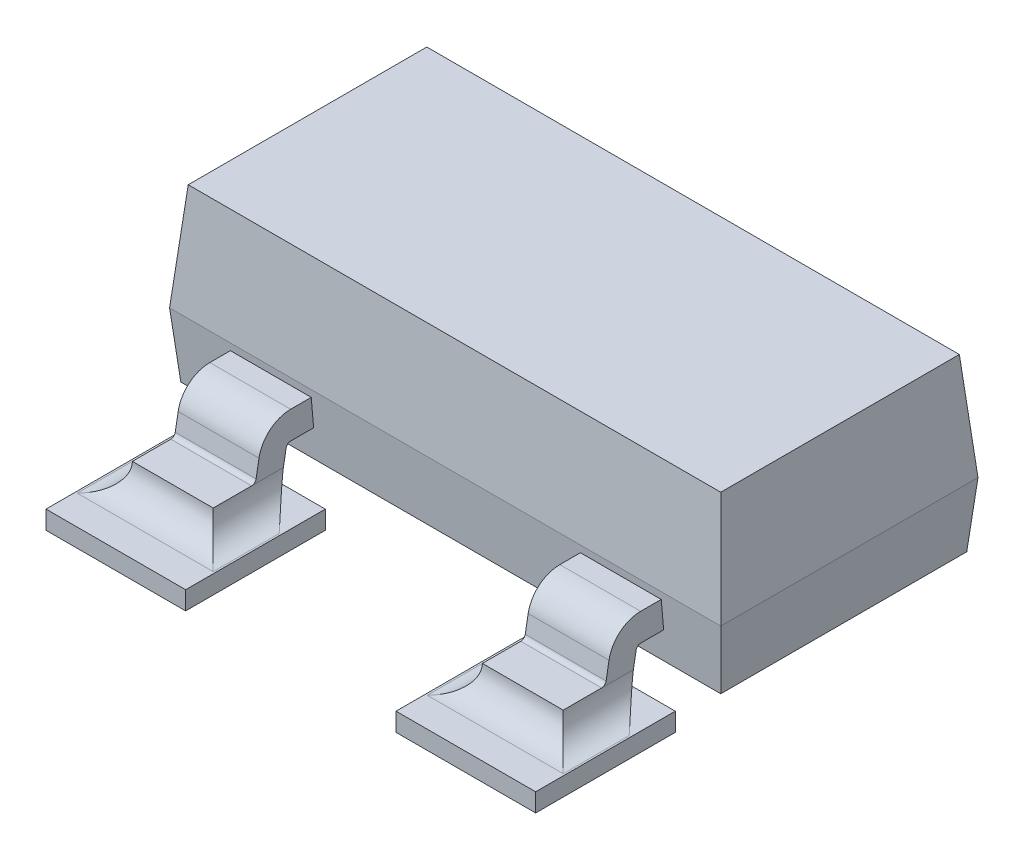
ISO-10303-21;
HEADER;
FILE_DESCRIPTION(('STEP AP214'),'2;1');
FILE_NAME('part.step','',(''),(''),'','','');
FILE_SCHEMA(('AUTOMOTIVE_DESIGN { 1 0 10303 214 1 1 1 1 }'));
ENDSEC;
DATA;
#1=APPLICATION_CONTEXT('core data for automotive mechanical design processes');
#2=APPLICATION_PROTOCOL_DEFINITION('international standard','automotive_design',2000,#1);
#3=PRODUCT_CONTEXT('',#1,'mechanical');
#4=PRODUCT('Part','Part','',(#3));
#5=PRODUCT_RELATED_PRODUCT_CATEGORY('part','',(#4));
#6=PRODUCT_DEFINITION_FORMATION('','',#4);
#7=PRODUCT_DEFINITION_CONTEXT('part definition',#1,'design');
#8=PRODUCT_DEFINITION('design','',#6,#7);
#9=PRODUCT_DEFINITION_SHAPE('','',#8);
#10=(LENGTH_UNIT() NAMED_UNIT(*) SI_UNIT(.MILLI.,.METRE.));
#11=(NAMED_UNIT(*) PLANE_ANGLE_UNIT() SI_UNIT($,.RADIAN.));
#12=(NAMED_UNIT(*) SI_UNIT($,.STERADIAN.) SOLID_ANGLE_UNIT());
#13=UNCERTAINTY_MEASURE_WITH_UNIT(LENGTH_MEASURE(1.E-05),#10,'distance_accuracy_value','');
#14=(GEOMETRIC_REPRESENTATION_CONTEXT(3) GLOBAL_UNCERTAINTY_ASSIGNED_CONTEXT((#13)) GLOBAL_UNIT_ASSIGNED_CONTEXT((#10,
#11,#12)) REPRESENTATION_CONTEXT('',''));
#15=CARTESIAN_POINT('',(0.,0.,0.));
#16=DIRECTION('',(0.,0.,1.));
#17=DIRECTION('',(1.,0.,0.));
#18=AXIS2_PLACEMENT_3D('',#15,#16,#17);
#19=CARTESIAN_POINT('',(0.22,0.28,-1.0548506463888));
#20=DIRECTION('',(1.,0.,0.));
#21=DIRECTION('',(0.,0.,-1.));
#22=AXIS2_PLACEMENT_3D('',#19,#20,#21);
#23=PLANE('',#22);
#24=DIRECTION('',(0.,-0.986393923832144,-0.164398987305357));
#25=VECTOR('',#24,1.);
#26=CARTESIAN_POINT('',(0.22,0.365753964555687,-0.853006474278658));
#27=LINE('',#26,#25);
#28=CARTESIAN_POINT('',(0.22,0.365753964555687,-0.853006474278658));
#29=VERTEX_POINT('',#28);
#30=CARTESIAN_POINT('',(0.22,0.255,-0.871465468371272));
#31=VERTEX_POINT('',#30);
#32=EDGE_CURVE('E660',#29,#31,#27,.T.);
#33=ORIENTED_EDGE('',*,*,#32,.T.);
#34=DIRECTION('',(0.,0.,-1.));
#35=VECTOR('',#34,1.);
#36=CARTESIAN_POINT('',(0.22,0.255,-1.0548506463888));
#37=LINE('',#36,#35);
#38=CARTESIAN_POINT('',(0.22,0.255,-1.03035574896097));
#39=VERTEX_POINT('',#38);
#40=EDGE_CURVE('E774',#31,#39,#37,.T.);
#41=ORIENTED_EDGE('',*,*,#40,.T.);
#42=CARTESIAN_POINT('',(0.22,0.28,-1.0548506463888));
#43=DIRECTION('',(1.,0.,0.));
#44=DIRECTION('',(0.,0.,-1.));
#45=AXIS2_PLACEMENT_3D('',#42,#43,#44);
#46=CIRCLE('',#45,0.035);
#47=CARTESIAN_POINT('',(0.22,0.274246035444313,-1.02032685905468));
#48=VERTEX_POINT('',#47);
#49=EDGE_CURVE('E645',#48,#39,#46,.T.);
#50=ORIENTED_EDGE('',*,*,#49,.F.);
#51=DIRECTION('',(0.,-0.986393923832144,-0.164398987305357));
#52=VECTOR('',#51,1.);
#53=CARTESIAN_POINT('',(0.22,0.39041381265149,-1.00096556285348));
#54=LINE('',#53,#52);
#55=CARTESIAN_POINT('',(0.22,0.39041381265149,-1.00096556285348));
#56=VERTEX_POINT('',#55);
#57=EDGE_CURVE('E648',#56,#48,#54,.T.);
#58=ORIENTED_EDGE('',*,*,#57,.F.);
#59=CARTESIAN_POINT('',(0.22,0.36,-0.818482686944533));
#60=DIRECTION('',(1.,0.,0.));
#61=DIRECTION('',(0.,0.,-1.));
#62=AXIS2_PLACEMENT_3D('',#59,#60,#61);
#63=CIRCLE('',#62,0.185);
#64=CARTESIAN_POINT('',(0.22,0.545,-0.818482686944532));
#65=VERTEX_POINT('',#64);
#66=EDGE_CURVE('E651',#65,#56,#63,.F.);
#67=ORIENTED_EDGE('',*,*,#66,.F.);
#68=DIRECTION('',(0.,0.,-1.));
#69=VECTOR('',#68,1.);
#70=CARTESIAN_POINT('',(0.22,0.545,-0.5));
#71=LINE('',#70,#69);
#72=CARTESIAN_POINT('',(0.22,0.545,-0.69956255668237));
#73=VERTEX_POINT('',#72);
#74=EDGE_CURVE('E654',#73,#65,#71,.T.);
#75=ORIENTED_EDGE('',*,*,#74,.F.);
#76=DIRECTION('',(0.,0.996194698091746,-0.0871557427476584));
#77=VECTOR('',#76,1.);
#78=CARTESIAN_POINT('',(0.22,0.2,-0.669378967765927));
#79=LINE('',#78,#77);
#80=CARTESIAN_POINT('',(0.22,0.395,-0.686439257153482));
#81=VERTEX_POINT('',#80);
#82=EDGE_CURVE('E750',#81,#73,#79,.T.);
#83=ORIENTED_EDGE('',*,*,#82,.F.);
#84=DIRECTION('',(0.,0.,-1.));
#85=VECTOR('',#84,1.);
#86=CARTESIAN_POINT('',(0.22,0.395,-0.5));
#87=LINE('',#86,#85);
#88=CARTESIAN_POINT('',(0.22,0.395,-0.818482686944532));
#89=VERTEX_POINT('',#88);
#90=EDGE_CURVE('E656',#81,#89,#87,.T.);
#91=ORIENTED_EDGE('',*,*,#90,.T.);
#92=CARTESIAN_POINT('',(0.22,0.36,-0.818482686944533));
#93=DIRECTION('',(1.,0.,0.));
#94=DIRECTION('',(0.,0.,-1.));
#95=AXIS2_PLACEMENT_3D('',#92,#93,#94);
#96=CIRCLE('',#95,0.035);
#97=EDGE_CURVE('E658',#89,#29,#96,.F.);
#98=ORIENTED_EDGE('',*,*,#97,.T.);
#99=EDGE_LOOP('',(#33,#41,#50,#58,#67,#75,#83,#91,#98));
#100=FACE_BOUND('',#99,.T.);
#101=ADVANCED_FACE('F27',(#100),#23,.T.);
#102=CARTESIAN_POINT('',(-0.22,0.28,-1.0548506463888));
#103=DIRECTION('',(1.,0.,0.));
#104=DIRECTION('',(0.,0.,-1.));
#105=AXIS2_PLACEMENT_3D('',#102,#103,#104);
#106=PLANE('',#105);
#107=CARTESIAN_POINT('',(-0.22,0.28,-1.0548506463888));
#108=DIRECTION('',(1.,0.,0.));
#109=DIRECTION('',(0.,0.,-1.));
#110=AXIS2_PLACEMENT_3D('',#107,#108,#109);
#111=CIRCLE('',#110,0.035);
#112=CARTESIAN_POINT('',(-0.22,0.274246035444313,-1.02032685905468));
#113=VERTEX_POINT('',#112);
#114=CARTESIAN_POINT('',(-0.22,0.255,-1.03035574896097));
#115=VERTEX_POINT('',#114);
#116=EDGE_CURVE('E627',#113,#115,#111,.T.);
#117=ORIENTED_EDGE('',*,*,#116,.T.);
#118=DIRECTION('',(0.,0.,-1.));
#119=VECTOR('',#118,1.);
#120=CARTESIAN_POINT('',(-0.22,0.255,-0.994850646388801));
#121=LINE('',#120,#119);
#122=CARTESIAN_POINT('',(-0.22,0.255,-0.871465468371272));
#123=VERTEX_POINT('',#122);
#124=EDGE_CURVE('E784',#115,#123,#121,.F.);
#125=ORIENTED_EDGE('',*,*,#124,.T.);
#126=DIRECTION('',(0.,-0.986393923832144,-0.164398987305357));
#127=VECTOR('',#126,1.);
#128=CARTESIAN_POINT('',(-0.22,0.365753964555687,-0.853006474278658));
#129=LINE('',#128,#127);
#130=CARTESIAN_POINT('',(-0.22,0.365753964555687,-0.853006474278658));
#131=VERTEX_POINT('',#130);
#132=EDGE_CURVE('E642',#131,#123,#129,.T.);
#133=ORIENTED_EDGE('',*,*,#132,.F.);
#134=CARTESIAN_POINT('',(-0.22,0.36,-0.818482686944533));
#135=DIRECTION('',(1.,0.,0.));
#136=DIRECTION('',(0.,0.,-1.));
#137=AXIS2_PLACEMENT_3D('',#134,#135,#136);
#138=CIRCLE('',#137,0.035);
#139=CARTESIAN_POINT('',(-0.22,0.395,-0.818482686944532));
#140=VERTEX_POINT('',#139);
#141=EDGE_CURVE('E640',#140,#131,#138,.F.);
#142=ORIENTED_EDGE('',*,*,#141,.F.);
#143=DIRECTION('',(0.,0.,-1.));
#144=VECTOR('',#143,1.);
#145=CARTESIAN_POINT('',(-0.22,0.395,-0.5));
#146=LINE('',#145,#144);
#147=CARTESIAN_POINT('',(-0.22,0.395,-0.686439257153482));
#148=VERTEX_POINT('',#147);
#149=EDGE_CURVE('E638',#148,#140,#146,.T.);
#150=ORIENTED_EDGE('',*,*,#149,.F.);
#151=DIRECTION('',(0.,0.996194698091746,-0.0871557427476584));
#152=VECTOR('',#151,1.);
#153=CARTESIAN_POINT('',(-0.22,0.2,-0.669378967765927));
#154=LINE('',#153,#152);
#155=CARTESIAN_POINT('',(-0.22,0.545,-0.69956255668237));
#156=VERTEX_POINT('',#155);
#157=EDGE_CURVE('E742',#148,#156,#154,.T.);
#158=ORIENTED_EDGE('',*,*,#157,.T.);
#159=DIRECTION('',(0.,0.,-1.));
#160=VECTOR('',#159,1.);
#161=CARTESIAN_POINT('',(-0.22,0.545,-0.5));
#162=LINE('',#161,#160);
#163=CARTESIAN_POINT('',(-0.22,0.545,-0.818482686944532));
#164=VERTEX_POINT('',#163);
#165=EDGE_CURVE('E636',#156,#164,#162,.T.);
#166=ORIENTED_EDGE('',*,*,#165,.T.);
#167=CARTESIAN_POINT('',(-0.22,0.36,-0.818482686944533));
#168=DIRECTION('',(1.,0.,0.));
#169=DIRECTION('',(0.,0.,-1.));
#170=AXIS2_PLACEMENT_3D('',#167,#168,#169);
#171=CIRCLE('',#170,0.185);
#172=CARTESIAN_POINT('',(-0.22,0.39041381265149,-1.00096556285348));
#173=VERTEX_POINT('',#172);
#174=EDGE_CURVE('E633',#164,#173,#171,.F.);
#175=ORIENTED_EDGE('',*,*,#174,.T.);
#176=DIRECTION('',(0.,-0.986393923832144,-0.164398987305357));
#177=VECTOR('',#176,1.);
#178=CARTESIAN_POINT('',(-0.22,0.39041381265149,-1.00096556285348));
#179=LINE('',#178,#177);
#180=EDGE_CURVE('E630',#173,#113,#179,.T.);
#181=ORIENTED_EDGE('',*,*,#180,.T.);
#182=EDGE_LOOP('',(#117,#125,#133,#142,#150,#158,#166,#175,#181));
#183=FACE_BOUND('',#182,.T.);
#184=ADVANCED_FACE('F867',(#183),#106,.F.);
#185=CARTESIAN_POINT('',(0.22,0.28,-1.0548506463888));
#186=DIRECTION('',(-1.,0.,0.));
#187=DIRECTION('',(0.,0.,1.));
#188=AXIS2_PLACEMENT_3D('',#185,#186,#187);
#189=CYLINDRICAL_SURFACE('',#188,0.185);
#190=DIRECTION('',(-1.,0.,0.));
#191=VECTOR('',#190,1.);
#192=CARTESIAN_POINT('',(0.22,0.105,-0.994850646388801));
#193=LINE('',#192,#191);
#194=CARTESIAN_POINT('',(0.37,0.105,-0.994850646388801));
#195=VERTEX_POINT('',#194);
#196=CARTESIAN_POINT('',(-0.37,0.105,-0.994850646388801));
#197=VERTEX_POINT('',#196);
#198=EDGE_CURVE('E772',#195,#197,#193,.T.);
#199=ORIENTED_EDGE('',*,*,#198,.F.);
#200=CARTESIAN_POINT('',(0.37,0.105,-0.994850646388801));
#201=CARTESIAN_POINT('',(0.366240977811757,0.104996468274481,-0.994870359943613));
#202=CARTESIAN_POINT('',(0.362525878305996,0.105140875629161,-0.994437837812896));
#203=CARTESIAN_POINT('',(0.355336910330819,0.105676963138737,-0.992904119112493));
#204=CARTESIAN_POINT('',(0.351859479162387,0.106062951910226,-0.991818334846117));
#205=CARTESIAN_POINT('',(0.343312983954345,0.107299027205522,-0.988490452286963));
#206=CARTESIAN_POINT('',(0.338392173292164,0.108287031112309,-0.985940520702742));
#207=CARTESIAN_POINT('',(0.328903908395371,0.110656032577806,-0.980302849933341));
#208=CARTESIAN_POINT('',(0.324342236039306,0.112042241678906,-0.977208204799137));
#209=CARTESIAN_POINT('',(0.310329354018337,0.117000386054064,-0.967012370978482));
#210=CARTESIAN_POINT('',(0.301428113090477,0.12122722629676,-0.959474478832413));
#211=CARTESIAN_POINT('',(0.284629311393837,0.131281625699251,-0.944437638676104));
#212=CARTESIAN_POINT('',(0.276728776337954,0.13710427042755,-0.936938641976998));
#213=CARTESIAN_POINT('',(0.26323236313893,0.149317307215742,-0.923648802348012));
#214=CARTESIAN_POINT('',(0.257472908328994,0.155443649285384,-0.917784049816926));
#215=CARTESIAN_POINT('',(0.246861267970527,0.16891793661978,-0.906655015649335));
#216=CARTESIAN_POINT('',(0.242008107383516,0.176264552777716,-0.901390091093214));
#217=CARTESIAN_POINT('',(0.234511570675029,0.190268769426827,-0.892913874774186));
#218=CARTESIAN_POINT('',(0.231617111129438,0.196675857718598,-0.88951178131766));
#219=CARTESIAN_POINT('',(0.226695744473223,0.210113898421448,-0.883400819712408));
#220=CARTESIAN_POINT('',(0.224666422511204,0.217143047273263,-0.880690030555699));
#221=CARTESIAN_POINT('',(0.222304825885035,0.228477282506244,-0.877118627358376));
#222=CARTESIAN_POINT('',(0.221618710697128,0.232620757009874,-0.875968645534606));
#223=CARTESIAN_POINT('',(0.220592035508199,0.241025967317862,-0.873950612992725));
#224=CARTESIAN_POINT('',(0.220252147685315,0.245287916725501,-0.87308311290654));
#225=CARTESIAN_POINT('',(0.220097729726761,0.249586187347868,-0.872367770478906));
#226=B_SPLINE_CURVE_WITH_KNOTS('',3,(#200,#201,#202,#203,#204,#205,#206,#207,#208,#209,#210,
#211,#212,#213,#214,#215,#216,#217,#218,#219,#220,#221,#222,#223,#224,#225),.UNSPECIFIED.,.F.,
.F.,(4,2,2,2,2,2,2,2,2,2,2,2,4),(0.,0.0111808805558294,0.0221077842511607,0.0389033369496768,
0.0559295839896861,0.092953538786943,0.129864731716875,0.160511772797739,0.191125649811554,
0.214471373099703,0.237751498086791,0.250792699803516,0.263859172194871),.UNSPECIFIED.);
#227=CARTESIAN_POINT('',(0.220097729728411,0.24958618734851,-0.872367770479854));
#228=VERTEX_POINT('',#227);
#229=EDGE_CURVE('E873',#195,#228,#226,.T.);
#230=ORIENTED_EDGE('',*,*,#229,.T.);
#231=DIRECTION('',(-1.,0.,0.));
#232=VECTOR('',#231,1.);
#233=CARTESIAN_POINT('',(0.22,0.24958618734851,-0.872367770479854));
#234=LINE('',#233,#232);
#235=CARTESIAN_POINT('',(-0.220097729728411,0.24958618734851,-0.872367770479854));
#236=VERTEX_POINT('',#235);
#237=EDGE_CURVE('E663',#228,#236,#234,.T.);
#238=ORIENTED_EDGE('',*,*,#237,.T.);
#239=CARTESIAN_POINT('',(-0.220097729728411,0.24958618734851,-0.872367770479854));
#240=CARTESIAN_POINT('',(-0.220366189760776,0.241917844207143,-0.873634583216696));
#241=CARTESIAN_POINT('',(-0.221234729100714,0.234383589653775,-0.875397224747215));
#242=CARTESIAN_POINT('',(-0.223998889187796,0.219823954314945,-0.879750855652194));
#243=CARTESIAN_POINT('',(-0.225885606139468,0.21279475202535,-0.88233458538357));
#244=CARTESIAN_POINT('',(-0.23051338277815,0.199376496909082,-0.888181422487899));
#245=CARTESIAN_POINT('',(-0.233250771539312,0.192984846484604,-0.891441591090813));
#246=CARTESIAN_POINT('',(-0.239424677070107,0.180862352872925,-0.89849864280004));
#247=CARTESIAN_POINT('',(-0.242862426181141,0.175132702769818,-0.902296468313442));
#248=CARTESIAN_POINT('',(-0.252159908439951,0.161671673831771,-0.912286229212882));
#249=CARTESIAN_POINT('',(-0.258372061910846,0.15436866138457,-0.918726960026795));
#250=CARTESIAN_POINT('',(-0.271784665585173,0.141234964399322,-0.932141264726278));
#251=CARTESIAN_POINT('',(-0.278990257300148,0.135412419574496,-0.939117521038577));
#252=CARTESIAN_POINT('',(-0.29447531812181,0.125055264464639,-0.953373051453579));
#253=CARTESIAN_POINT('',(-0.302780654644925,0.120564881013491,-0.960655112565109));
#254=CARTESIAN_POINT('',(-0.320454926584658,0.113091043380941,-0.97469132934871));
#255=CARTESIAN_POINT('',(-0.329813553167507,0.110094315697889,-0.981449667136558));
#256=CARTESIAN_POINT('',(-0.34323493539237,0.107375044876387,-0.98830017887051));
#257=CARTESIAN_POINT('',(-0.346404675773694,0.106830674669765,-0.989741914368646));
#258=CARTESIAN_POINT('',(-0.352927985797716,0.105938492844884,-0.992167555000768));
#259=CARTESIAN_POINT('',(-0.356280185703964,0.105589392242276,-0.993154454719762));
#260=CARTESIAN_POINT('',(-0.361387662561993,0.105237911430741,-0.994160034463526));
#261=CARTESIAN_POINT('',(-0.363091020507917,0.105149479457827,-0.994415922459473));
#262=CARTESIAN_POINT('',(-0.36652887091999,0.10503015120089,-0.994762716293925));
#263=CARTESIAN_POINT('',(-0.368263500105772,0.104999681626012,-0.994852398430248));
#264=CARTESIAN_POINT('',(-0.37,0.105,-0.994850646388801));
#265=B_SPLINE_CURVE_WITH_KNOTS('',3,(#239,#240,#241,#242,#243,#244,#245,#246,#247,#248,#249,
#250,#251,#252,#253,#254,#255,#256,#257,#258,#259,#260,#261,#262,#263,#264),.UNSPECIFIED.,.F.,
.F.,(4,2,2,2,2,2,2,2,2,2,2,2,4),(0.,0.0232476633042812,0.0462952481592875,0.0692447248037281,
0.0922349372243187,0.126700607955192,0.161351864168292,0.197050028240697,0.232425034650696,
0.242972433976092,0.253449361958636,0.2586151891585,0.263818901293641),.UNSPECIFIED.);
#266=EDGE_CURVE('E853',#236,#197,#265,.T.);
#267=ORIENTED_EDGE('',*,*,#266,.T.);
#268=EDGE_LOOP('',(#199,#230,#238,#267));
#269=FACE_BOUND('',#268,.T.);
#270=ADVANCED_FACE('F862',(#269),#189,.T.);
#271=CARTESIAN_POINT('',(1.5,0.55,0.7));
#272=DIRECTION('',(0.,-0.0871557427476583,-0.996194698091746));
#273=DIRECTION('',(0.,0.996194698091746,-0.0871557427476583));
#274=AXIS2_PLACEMENT_3D('',#271,#272,#273);
#275=PLANE('',#274);
#276=DIRECTION('',(-1.,0.,0.));
#277=VECTOR('',#276,1.);
#278=CARTESIAN_POINT('',(1.5,1.13,0.649256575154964));
#279=LINE('',#278,#277);
#280=CARTESIAN_POINT('',(1.44925657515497,1.13,0.649256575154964));
#281=VERTEX_POINT('',#280);
#282=CARTESIAN_POINT('',(-1.44925657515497,1.13,0.649256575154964));
#283=VERTEX_POINT('',#282);
#284=EDGE_CURVE('E724',#281,#283,#279,.T.);
#285=ORIENTED_EDGE('',*,*,#284,.T.);
#286=DIRECTION('',(-0.0868265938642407,-0.992432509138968,0.0868265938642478));
#287=VECTOR('',#286,1.);
#288=CARTESIAN_POINT('',(-1.4773834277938,0.808508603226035,0.677383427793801));
#289=LINE('',#288,#287);
#290=CARTESIAN_POINT('',(-1.5,0.55,0.7));
#291=VERTEX_POINT('',#290);
#292=EDGE_CURVE('E691',#283,#291,#289,.T.);
#293=ORIENTED_EDGE('',*,*,#292,.T.);
#294=DIRECTION('',(-1.,0.,0.));
#295=VECTOR('',#294,1.);
#296=CARTESIAN_POINT('',(1.5,0.55,0.7));
#297=LINE('',#296,#295);
#298=CARTESIAN_POINT('',(1.5,0.55,0.7));
#299=VERTEX_POINT('',#298);
#300=EDGE_CURVE('E739',#299,#291,#297,.T.);
#301=ORIENTED_EDGE('',*,*,#300,.F.);
#302=DIRECTION('',(-0.0868265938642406,0.992432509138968,-0.0868265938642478));
#303=VECTOR('',#302,1.);
#304=CARTESIAN_POINT('',(1.5,0.55,0.7));
#305=LINE('',#304,#303);
#306=EDGE_CURVE('E721',#299,#281,#305,.T.);
#307=ORIENTED_EDGE('',*,*,#306,.T.);
#308=EDGE_LOOP('',(#285,#293,#301,#307));
#309=FACE_BOUND('',#308,.T.);
#310=ADVANCED_FACE('F29',(#309),#275,.F.);
#311=CARTESIAN_POINT('',(1.5,0.2,0.669378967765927));
#312=DIRECTION('',(0.,0.0871557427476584,-0.996194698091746));
#313=DIRECTION('',(0.,0.996194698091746,0.0871557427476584));
#314=AXIS2_PLACEMENT_3D('',#311,#312,#313);
#315=PLANE('',#314);
#316=DIRECTION('',(1.,0.,0.));
#317=VECTOR('',#316,1.);
#318=CARTESIAN_POINT('',(1.5,0.50992807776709,0.696494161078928));
#319=LINE('',#318,#317);
#320=CARTESIAN_POINT('',(-1.1725,0.50992807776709,0.696494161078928));
#321=VERTEX_POINT('',#320);
#322=CARTESIAN_POINT('',(-0.7325,0.50992807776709,0.696494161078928));
#323=VERTEX_POINT('',#322);
#324=EDGE_CURVE('E765',#321,#323,#319,.T.);
#325=ORIENTED_EDGE('',*,*,#324,.T.);
#326=DIRECTION('',(0.,-0.996194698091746,-0.0871557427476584));
#327=VECTOR('',#326,1.);
#328=CARTESIAN_POINT('',(-0.7325,0.2,0.669378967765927));
#329=LINE('',#328,#327);
#330=CARTESIAN_POINT('',(-0.7325,0.35992807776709,0.683370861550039));
#331=VERTEX_POINT('',#330);
#332=EDGE_CURVE('E770',#323,#331,#329,.T.);
#333=ORIENTED_EDGE('',*,*,#332,.T.);
#334=DIRECTION('',(1.,0.,0.));
#335=VECTOR('',#334,1.);
#336=CARTESIAN_POINT('',(1.5,0.35992807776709,0.683370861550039));
#337=LINE('',#336,#335);
#338=CARTESIAN_POINT('',(-1.1725,0.35992807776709,0.683370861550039));
#339=VERTEX_POINT('',#338);
#340=EDGE_CURVE('E767',#339,#331,#337,.T.);
#341=ORIENTED_EDGE('',*,*,#340,.F.);
#342=DIRECTION('',(0.,-0.996194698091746,-0.0871557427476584));
#343=VECTOR('',#342,1.);
#344=CARTESIAN_POINT('',(-1.1725,0.2,0.669378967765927));
#345=LINE('',#344,#343);
#346=EDGE_CURVE('E762',#321,#339,#345,.T.);
#347=ORIENTED_EDGE('',*,*,#346,.F.);
#348=EDGE_LOOP('',(#325,#333,#341,#347));
#349=FACE_BOUND('',#348,.T.);
#350=DIRECTION('',(1.,0.,0.));
#351=VECTOR('',#350,1.);
#352=CARTESIAN_POINT('',(1.5,0.50992807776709,0.696494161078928));
#353=LINE('',#352,#351);
#354=CARTESIAN_POINT('',(0.7325,0.50992807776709,0.696494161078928));
#355=VERTEX_POINT('',#354);
#356=CARTESIAN_POINT('',(1.1725,0.50992807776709,0.696494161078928));
#357=VERTEX_POINT('',#356);
#358=EDGE_CURVE('E755',#355,#357,#353,.T.);
#359=ORIENTED_EDGE('',*,*,#358,.T.);
#360=DIRECTION('',(0.,-0.996194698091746,-0.0871557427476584));
#361=VECTOR('',#360,1.);
#362=CARTESIAN_POINT('',(1.1725,0.2,0.669378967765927));
#363=LINE('',#362,#361);
#364=CARTESIAN_POINT('',(1.1725,0.35992807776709,0.683370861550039));
#365=VERTEX_POINT('',#364);
#366=EDGE_CURVE('E760',#357,#365,#363,.T.);
#367=ORIENTED_EDGE('',*,*,#366,.T.);
#368=DIRECTION('',(1.,0.,0.));
#369=VECTOR('',#368,1.);
#370=CARTESIAN_POINT('',(1.5,0.35992807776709,0.683370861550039));
#371=LINE('',#370,#369);
#372=CARTESIAN_POINT('',(0.7325,0.35992807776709,0.683370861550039));
#373=VERTEX_POINT('',#372);
#374=EDGE_CURVE('E757',#373,#365,#371,.T.);
#375=ORIENTED_EDGE('',*,*,#374,.F.);
#376=DIRECTION('',(0.,-0.996194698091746,-0.0871557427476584));
#377=VECTOR('',#376,1.);
#378=CARTESIAN_POINT('',(0.7325,0.2,0.669378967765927));
#379=LINE('',#378,#377);
#380=EDGE_CURVE('E752',#355,#373,#379,.T.);
#381=ORIENTED_EDGE('',*,*,#380,.F.);
#382=EDGE_LOOP('',(#359,#367,#375,#381));
#383=FACE_BOUND('',#382,.T.);
#384=ORIENTED_EDGE('',*,*,#300,.T.);
#385=DIRECTION('',(0.086826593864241,-0.992432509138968,-0.0868265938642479));
#386=VECTOR('',#385,1.);
#387=CARTESIAN_POINT('',(-1.44699324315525,-0.0558700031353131,0.646993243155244));
#388=LINE('',#387,#386);
#389=CARTESIAN_POINT('',(-1.46937896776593,0.2,0.669378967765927));
#390=VERTEX_POINT('',#389);
#391=EDGE_CURVE('E700',#291,#390,#388,.T.);
#392=ORIENTED_EDGE('',*,*,#391,.T.);
#393=DIRECTION('',(-1.,0.,0.));
#394=VECTOR('',#393,1.);
#395=CARTESIAN_POINT('',(1.5,0.2,0.669378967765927));
#396=LINE('',#395,#394);
#397=CARTESIAN_POINT('',(1.46937896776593,0.2,0.669378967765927));
#398=VERTEX_POINT('',#397);
#399=EDGE_CURVE('E736',#398,#390,#396,.T.);
#400=ORIENTED_EDGE('',*,*,#399,.F.);
#401=DIRECTION('',(0.0868265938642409,0.992432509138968,0.0868265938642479));
#402=VECTOR('',#401,1.);
#403=CARTESIAN_POINT('',(1.46960981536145,0.202638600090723,0.669609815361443));
#404=LINE('',#403,#402);
#405=EDGE_CURVE('E712',#398,#299,#404,.T.);
#406=ORIENTED_EDGE('',*,*,#405,.T.);
#407=EDGE_LOOP('',(#384,#392,#400,#406));
#408=FACE_BOUND('',#407,.T.);
#409=ADVANCED_FACE('F1174',(#349,#383,#408),#315,.F.);
#410=CARTESIAN_POINT('',(1.5,0.2,0.669378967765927));
#411=DIRECTION('',(0.,1.,0.));
#412=DIRECTION('',(0.,0.,1.));
#413=AXIS2_PLACEMENT_3D('',#410,#411,#412);
#414=PLANE('',#413);
#415=ORIENTED_EDGE('',*,*,#399,.T.);
#416=DIRECTION('',(0.,0.,-1.));
#417=VECTOR('',#416,1.);
#418=CARTESIAN_POINT('',(-1.46937896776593,0.2,0.669378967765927));
#419=LINE('',#418,#417);
#420=CARTESIAN_POINT('',(-1.46937896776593,0.2,-0.669378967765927));
#421=VERTEX_POINT('',#420);
#422=EDGE_CURVE('E697',#390,#421,#419,.T.);
#423=ORIENTED_EDGE('',*,*,#422,.T.);
#424=DIRECTION('',(-1.,0.,0.));
#425=VECTOR('',#424,1.);
#426=CARTESIAN_POINT('',(1.5,0.2,-0.669378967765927));
#427=LINE('',#426,#425);
#428=CARTESIAN_POINT('',(1.46937896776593,0.2,-0.669378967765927));
#429=VERTEX_POINT('',#428);
#430=EDGE_CURVE('E733',#429,#421,#427,.T.);
#431=ORIENTED_EDGE('',*,*,#430,.F.);
#432=DIRECTION('',(0.,0.,1.));
#433=VECTOR('',#432,1.);
#434=CARTESIAN_POINT('',(1.46937896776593,0.2,0.669378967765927));
#435=LINE('',#434,#433);
#436=EDGE_CURVE('E709',#429,#398,#435,.T.);
#437=ORIENTED_EDGE('',*,*,#436,.T.);
#438=EDGE_LOOP('',(#415,#423,#431,#437));
#439=FACE_BOUND('',#438,.T.);
#440=ADVANCED_FACE('F1178',(#439),#414,.F.);
#441=CARTESIAN_POINT('',(1.5,0.2,-0.669378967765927));
#442=DIRECTION('',(0.,0.0871557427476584,0.996194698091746));
#443=DIRECTION('',(0.,-0.996194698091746,0.0871557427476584));
#444=AXIS2_PLACEMENT_3D('',#441,#442,#443);
#445=PLANE('',#444);
#446=DIRECTION('',(-1.,0.,0.));
#447=VECTOR('',#446,1.);
#448=CARTESIAN_POINT('',(1.5,0.395,-0.686439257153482));
#449=LINE('',#448,#447);
#450=EDGE_CURVE('E745',#81,#148,#449,.T.);
#451=ORIENTED_EDGE('',*,*,#450,.F.);
#452=ORIENTED_EDGE('',*,*,#82,.T.);
#453=DIRECTION('',(-1.,0.,0.));
#454=VECTOR('',#453,1.);
#455=CARTESIAN_POINT('',(1.5,0.545,-0.69956255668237));
#456=LINE('',#455,#454);
#457=EDGE_CURVE('E748',#73,#156,#456,.T.);
#458=ORIENTED_EDGE('',*,*,#457,.T.);
#459=ORIENTED_EDGE('',*,*,#157,.F.);
#460=EDGE_LOOP('',(#451,#452,#458,#459));
#461=FACE_BOUND('',#460,.T.);
#462=ORIENTED_EDGE('',*,*,#430,.T.);
#463=DIRECTION('',(-0.086826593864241,0.992432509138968,-0.0868265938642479));
#464=VECTOR('',#463,1.);
#465=CARTESIAN_POINT('',(-1.44699324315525,-0.0558700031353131,-0.646993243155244));
#466=LINE('',#465,#464);
#467=CARTESIAN_POINT('',(-1.5,0.55,-0.7));
#468=VERTEX_POINT('',#467);
#469=EDGE_CURVE('E694',#421,#468,#466,.T.);
#470=ORIENTED_EDGE('',*,*,#469,.T.);
#471=DIRECTION('',(-1.,0.,0.));
#472=VECTOR('',#471,1.);
#473=CARTESIAN_POINT('',(1.5,0.55,-0.7));
#474=LINE('',#473,#472);
#475=CARTESIAN_POINT('',(1.5,0.55,-0.7));
#476=VERTEX_POINT('',#475);
#477=EDGE_CURVE('E730',#476,#468,#474,.T.);
#478=ORIENTED_EDGE('',*,*,#477,.F.);
#479=DIRECTION('',(-0.0868265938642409,-0.992432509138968,0.0868265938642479));
#480=VECTOR('',#479,1.);
#481=CARTESIAN_POINT('',(1.46960981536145,0.202638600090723,-0.669609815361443));
#482=LINE('',#481,#480);
#483=EDGE_CURVE('E706',#476,#429,#482,.T.);
#484=ORIENTED_EDGE('',*,*,#483,.T.);
#485=EDGE_LOOP('',(#462,#470,#478,#484));
#486=FACE_BOUND('',#485,.T.);
#487=ADVANCED_FACE('F1249',(#461,#486),#445,.F.);
#488=CARTESIAN_POINT('',(1.5,0.55,-0.7));
#489=DIRECTION('',(0.,-0.0871557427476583,0.996194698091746));
#490=DIRECTION('',(0.,-0.996194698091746,-0.0871557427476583));
#491=AXIS2_PLACEMENT_3D('',#488,#489,#490);
#492=PLANE('',#491);
#493=ORIENTED_EDGE('',*,*,#477,.T.);
#494=DIRECTION('',(0.0868265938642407,0.992432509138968,0.0868265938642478));
#495=VECTOR('',#494,1.);
#496=CARTESIAN_POINT('',(-1.4773834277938,0.808508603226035,-0.677383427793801));
#497=LINE('',#496,#495);
#498=CARTESIAN_POINT('',(-1.44925657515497,1.13,-0.649256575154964));
#499=VERTEX_POINT('',#498);
#500=EDGE_CURVE('E688',#468,#499,#497,.T.);
#501=ORIENTED_EDGE('',*,*,#500,.T.);
#502=DIRECTION('',(-1.,0.,0.));
#503=VECTOR('',#502,1.);
#504=CARTESIAN_POINT('',(1.5,1.13,-0.649256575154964));
#505=LINE('',#504,#503);
#506=CARTESIAN_POINT('',(1.44925657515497,1.13,-0.649256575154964));
#507=VERTEX_POINT('',#506);
#508=EDGE_CURVE('E727',#507,#499,#505,.T.);
#509=ORIENTED_EDGE('',*,*,#508,.F.);
#510=DIRECTION('',(0.0868265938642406,-0.992432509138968,-0.0868265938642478));
#511=VECTOR('',#510,1.);
#512=CARTESIAN_POINT('',(1.5,0.55,-0.7));
#513=LINE('',#512,#511);
#514=EDGE_CURVE('E718',#507,#476,#513,.T.);
#515=ORIENTED_EDGE('',*,*,#514,.T.);
#516=EDGE_LOOP('',(#493,#501,#509,#515));
#517=FACE_BOUND('',#516,.T.);
#518=ADVANCED_FACE('F1253',(#517),#492,.F.);
#519=CARTESIAN_POINT('',(1.5,1.13,0.649256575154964));
#520=DIRECTION('',(0.,-1.,0.));
#521=DIRECTION('',(0.,0.,-1.));
#522=AXIS2_PLACEMENT_3D('',#519,#520,#521);
#523=PLANE('',#522);
#524=ORIENTED_EDGE('',*,*,#508,.T.);
#525=DIRECTION('',(0.,0.,1.));
#526=VECTOR('',#525,1.);
#527=CARTESIAN_POINT('',(-1.44925657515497,1.13,0.649256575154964));
#528=LINE('',#527,#526);
#529=EDGE_CURVE('E685',#499,#283,#528,.T.);
#530=ORIENTED_EDGE('',*,*,#529,.T.);
#531=ORIENTED_EDGE('',*,*,#284,.F.);
#532=DIRECTION('',(0.,0.,-1.));
#533=VECTOR('',#532,1.);
#534=CARTESIAN_POINT('',(1.44925657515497,1.13,0.649256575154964));
#535=LINE('',#534,#533);
#536=EDGE_CURVE('E715',#281,#507,#535,.T.);
#537=ORIENTED_EDGE('',*,*,#536,.T.);
#538=EDGE_LOOP('',(#524,#530,#531,#537));
#539=FACE_BOUND('',#538,.T.);
#540=ADVANCED_FACE('F1284',(#539),#523,.F.);
#541=CARTESIAN_POINT('',(1.43345168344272,1.31065073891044,-0.7));
#542=DIRECTION('',(-0.996194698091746,-0.0871557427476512,0.));
#543=DIRECTION('',(0.0871557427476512,-0.996194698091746,0.));
#544=AXIS2_PLACEMENT_3D('',#541,#542,#543);
#545=PLANE('',#544);
#546=DIRECTION('',(0.,0.,1.));
#547=VECTOR('',#546,1.);
#548=CARTESIAN_POINT('',(1.5,0.55,-0.7));
#549=LINE('',#548,#547);
#550=EDGE_CURVE('E703',#476,#299,#549,.T.);
#551=ORIENTED_EDGE('',*,*,#550,.F.);
#552=ORIENTED_EDGE('',*,*,#514,.F.);
#553=ORIENTED_EDGE('',*,*,#536,.F.);
#554=ORIENTED_EDGE('',*,*,#306,.F.);
#555=EDGE_LOOP('',(#551,#552,#553,#554));
#556=FACE_BOUND('',#555,.T.);
#557=ADVANCED_FACE('F1276',(#556),#545,.F.);
#558=CARTESIAN_POINT('',(1.5,0.55,-0.7));
#559=DIRECTION('',(-0.996194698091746,0.0871557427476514,0.));
#560=DIRECTION('',(-0.0871557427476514,-0.996194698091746,0.));
#561=AXIS2_PLACEMENT_3D('',#558,#559,#560);
#562=PLANE('',#561);
#563=ORIENTED_EDGE('',*,*,#436,.F.);
#564=ORIENTED_EDGE('',*,*,#483,.F.);
#565=ORIENTED_EDGE('',*,*,#550,.T.);
#566=ORIENTED_EDGE('',*,*,#405,.F.);
#567=EDGE_LOOP('',(#563,#564,#565,#566));
#568=FACE_BOUND('',#567,.T.);
#569=ADVANCED_FACE('F1268',(#568),#562,.F.);
#570=CARTESIAN_POINT('',(-1.5,0.55,-0.7));
#571=DIRECTION('',(0.996194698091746,0.0871557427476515,0.));
#572=DIRECTION('',(-0.0871557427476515,0.996194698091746,0.));
#573=AXIS2_PLACEMENT_3D('',#570,#571,#572);
#574=PLANE('',#573);
#575=DIRECTION('',(0.,0.,1.));
#576=VECTOR('',#575,1.);
#577=CARTESIAN_POINT('',(-1.5,0.55,-0.7));
#578=LINE('',#577,#576);
#579=EDGE_CURVE('E682',#468,#291,#578,.T.);
#580=ORIENTED_EDGE('',*,*,#579,.F.);
#581=ORIENTED_EDGE('',*,*,#469,.F.);
#582=ORIENTED_EDGE('',*,*,#422,.F.);
#583=ORIENTED_EDGE('',*,*,#391,.F.);
#584=EDGE_LOOP('',(#580,#581,#582,#583));
#585=FACE_BOUND('',#584,.T.);
#586=ADVANCED_FACE('F1261',(#585),#574,.F.);
#587=CARTESIAN_POINT('',(-1.43345168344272,1.31065073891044,-0.7));
#588=DIRECTION('',(0.996194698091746,-0.0871557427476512,0.));
#589=DIRECTION('',(0.0871557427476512,0.996194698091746,0.));
#590=AXIS2_PLACEMENT_3D('',#587,#588,#589);
#591=PLANE('',#590);
#592=ORIENTED_EDGE('',*,*,#529,.F.);
#593=ORIENTED_EDGE('',*,*,#500,.F.);
#594=ORIENTED_EDGE('',*,*,#579,.T.);
#595=ORIENTED_EDGE('',*,*,#292,.F.);
#596=EDGE_LOOP('',(#592,#593,#594,#595));
#597=FACE_BOUND('',#596,.T.);
#598=ADVANCED_FACE('F1243',(#597),#591,.F.);
#599=CARTESIAN_POINT('',(0.22,0.545,-0.5));
#600=DIRECTION('',(0.,1.,0.));
#601=DIRECTION('',(0.,0.,1.));
#602=AXIS2_PLACEMENT_3D('',#599,#600,#601);
#603=PLANE('',#602);
#604=ORIENTED_EDGE('',*,*,#457,.F.);
#605=ORIENTED_EDGE('',*,*,#74,.T.);
#606=DIRECTION('',(-1.,0.,0.));
#607=VECTOR('',#606,1.);
#608=CARTESIAN_POINT('',(0.22,0.545,-0.818482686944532));
#609=LINE('',#608,#607);
#610=EDGE_CURVE('E671',#65,#164,#609,.T.);
#611=ORIENTED_EDGE('',*,*,#610,.T.);
#612=ORIENTED_EDGE('',*,*,#165,.F.);
#613=EDGE_LOOP('',(#604,#605,#611,#612));
#614=FACE_BOUND('',#613,.T.);
#615=ADVANCED_FACE('F1234',(#614),#603,.T.);
#616=CARTESIAN_POINT('',(0.22,0.395,-0.5));
#617=DIRECTION('',(0.,1.,0.));
#618=DIRECTION('',(0.,0.,1.));
#619=AXIS2_PLACEMENT_3D('',#616,#617,#618);
#620=PLANE('',#619);
#621=ORIENTED_EDGE('',*,*,#90,.F.);
#622=ORIENTED_EDGE('',*,*,#450,.T.);
#623=ORIENTED_EDGE('',*,*,#149,.T.);
#624=DIRECTION('',(-1.,0.,0.));
#625=VECTOR('',#624,1.);
#626=CARTESIAN_POINT('',(0.22,0.395,-0.818482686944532));
#627=LINE('',#626,#625);
#628=EDGE_CURVE('E668',#89,#140,#627,.T.);
#629=ORIENTED_EDGE('',*,*,#628,.F.);
#630=EDGE_LOOP('',(#621,#622,#623,#629));
#631=FACE_BOUND('',#630,.T.);
#632=ADVANCED_FACE('F1230',(#631),#620,.F.);
#633=CARTESIAN_POINT('',(0.22,0.245,-1.0548506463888));
#634=DIRECTION('',(0.,1.,0.));
#635=DIRECTION('',(0.,0.,1.));
#636=AXIS2_PLACEMENT_3D('',#633,#634,#635);
#637=PLANE('',#636);
#638=DIRECTION('',(-1.,0.,0.));
#639=VECTOR('',#638,1.);
#640=CARTESIAN_POINT('',(0.22,0.245,-1.25634731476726));
#641=LINE('',#640,#639);
#642=CARTESIAN_POINT('',(0.220333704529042,0.245,-1.25634731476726));
#643=VERTEX_POINT('',#642);
#644=CARTESIAN_POINT('',(-0.220333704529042,0.245,-1.25634731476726));
#645=VERTEX_POINT('',#644);
#646=EDGE_CURVE('E680',#643,#645,#641,.T.);
#647=ORIENTED_EDGE('',*,*,#646,.T.);
#648=DIRECTION('',(0.,0.,1.));
#649=VECTOR('',#648,1.);
#650=CARTESIAN_POINT('',(-0.220333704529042,0.245,-1.25634731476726));
#651=LINE('',#650,#649);
#652=CARTESIAN_POINT('',(-0.220333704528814,0.245,-1.0548506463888));
#653=VERTEX_POINT('',#652);
#654=EDGE_CURVE('E842',#645,#653,#651,.T.);
#655=ORIENTED_EDGE('',*,*,#654,.T.);
#656=DIRECTION('',(-1.,0.,0.));
#657=VECTOR('',#656,1.);
#658=CARTESIAN_POINT('',(0.22,0.245,-1.0548506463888));
#659=LINE('',#658,#657);
#660=CARTESIAN_POINT('',(0.220333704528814,0.245,-1.0548506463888));
#661=VERTEX_POINT('',#660);
#662=EDGE_CURVE('E678',#661,#653,#659,.T.);
#663=ORIENTED_EDGE('',*,*,#662,.F.);
#664=DIRECTION('',(0.,0.,-1.));
#665=VECTOR('',#664,1.);
#666=CARTESIAN_POINT('',(0.220333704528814,0.245,-1.0548506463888));
#667=LINE('',#666,#665);
#668=EDGE_CURVE('E816',#661,#643,#667,.T.);
#669=ORIENTED_EDGE('',*,*,#668,.T.);
#670=EDGE_LOOP('',(#647,#655,#663,#669));
#671=FACE_BOUND('',#670,.T.);
#672=ADVANCED_FACE('F828',(#671),#637,.T.);
#673=CARTESIAN_POINT('',(0.22,0.28,-1.0548506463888));
#674=DIRECTION('',(-1.,0.,0.));
#675=DIRECTION('',(0.,0.,1.));
#676=AXIS2_PLACEMENT_3D('',#673,#674,#675);
#677=CYLINDRICAL_SURFACE('',#676,0.035);
#678=ORIENTED_EDGE('',*,*,#116,.F.);
#679=DIRECTION('',(-1.,0.,0.));
#680=VECTOR('',#679,1.);
#681=CARTESIAN_POINT('',(0.22,0.274246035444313,-1.02032685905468));
#682=LINE('',#681,#680);
#683=EDGE_CURVE('E676',#48,#113,#682,.T.);
#684=ORIENTED_EDGE('',*,*,#683,.F.);
#685=ORIENTED_EDGE('',*,*,#49,.T.);
#686=CARTESIAN_POINT('',(0.22,0.255,-1.03035574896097));
#687=CARTESIAN_POINT('',(0.220000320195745,0.253622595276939,-1.03175913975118));
#688=CARTESIAN_POINT('',(0.220019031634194,0.252366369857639,-1.03328030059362));
#689=CARTESIAN_POINT('',(0.220074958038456,0.250124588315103,-1.03651222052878));
#690=CARTESIAN_POINT('',(0.22011218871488,0.249139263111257,-1.03822313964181));
#691=CARTESIAN_POINT('',(0.220186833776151,0.247469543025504,-1.04178713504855));
#692=CARTESIAN_POINT('',(0.220224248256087,0.246785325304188,-1.04364029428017));
#693=CARTESIAN_POINT('',(0.220285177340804,0.245739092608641,-1.04743183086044));
#694=CARTESIAN_POINT('',(0.22030872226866,0.245376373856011,-1.04937001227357));
#695=CARTESIAN_POINT('',(0.22032981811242,0.245059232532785,-1.05249588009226));
#696=CARTESIAN_POINT('',(0.220334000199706,0.244999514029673,-1.05367357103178));
#697=CARTESIAN_POINT('',(0.220333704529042,0.245,-1.0548506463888));
#698=B_SPLINE_CURVE_WITH_KNOTS('',3,(#686,#687,#688,#689,#690,#691,#692,#693,#694,#695,#696,
#697),.UNSPECIFIED.,.F.,.F.,(4,2,2,2,2,4),(0.,0.00589110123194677,0.01178720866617,
0.0176867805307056,0.0235734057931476,0.0271047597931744),.UNSPECIFIED.);
#699=EDGE_CURVE('E808',#39,#661,#698,.T.);
#700=ORIENTED_EDGE('',*,*,#699,.T.);
#701=ORIENTED_EDGE('',*,*,#662,.T.);
#702=CARTESIAN_POINT('',(-0.220333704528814,0.245,-1.0548506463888));
#703=CARTESIAN_POINT('',(-0.220334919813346,0.244998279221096,-1.05288420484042));
#704=CARTESIAN_POINT('',(-0.220322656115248,0.245165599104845,-1.05091831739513));
#705=CARTESIAN_POINT('',(-0.220280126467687,0.245826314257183,-1.04704057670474));
#706=CARTESIAN_POINT('',(-0.220249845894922,0.246319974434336,-1.04512876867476));
#707=CARTESIAN_POINT('',(-0.22018024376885,0.24762173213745,-1.04141433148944));
#708=CARTESIAN_POINT('',(-0.220140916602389,0.248430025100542,-1.0396117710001));
#709=CARTESIAN_POINT('',(-0.220069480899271,0.25033634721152,-1.03617134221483));
#710=CARTESIAN_POINT('',(-0.220037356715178,0.251433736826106,-1.03453312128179));
#711=CARTESIAN_POINT('',(-0.220006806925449,0.253394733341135,-1.03207871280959));
#712=CARTESIAN_POINT('',(-0.220000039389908,0.254176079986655,-1.03119597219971));
#713=CARTESIAN_POINT('',(-0.22,0.255,-1.03035574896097));
#714=B_SPLINE_CURVE_WITH_KNOTS('',3,(#702,#703,#704,#705,#706,#707,#708,#709,#710,#711,#712,
#713),.UNSPECIFIED.,.F.,.F.,(4,2,2,2,2,4),(0.,0.00589140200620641,0.0117875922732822,
0.0176874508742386,0.0235743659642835,0.0271047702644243),.UNSPECIFIED.);
#715=EDGE_CURVE('E834',#653,#115,#714,.T.);
#716=ORIENTED_EDGE('',*,*,#715,.T.);
#717=EDGE_LOOP('',(#678,#684,#685,#700,#701,#716));
#718=FACE_BOUND('',#717,.T.);
#719=ADVANCED_FACE('F822',(#718),#677,.F.);
#720=CARTESIAN_POINT('',(0.22,0.39041381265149,-1.00096556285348));
#721=DIRECTION('',(0.,0.164398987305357,-0.986393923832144));
#722=DIRECTION('',(0.,0.986393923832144,0.164398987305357));
#723=AXIS2_PLACEMENT_3D('',#720,#721,#722);
#724=PLANE('',#723);
#725=ORIENTED_EDGE('',*,*,#180,.F.);
#726=DIRECTION('',(-1.,0.,0.));
#727=VECTOR('',#726,1.);
#728=CARTESIAN_POINT('',(0.22,0.39041381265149,-1.00096556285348));
#729=LINE('',#728,#727);
#730=EDGE_CURVE('E674',#56,#173,#729,.T.);
#731=ORIENTED_EDGE('',*,*,#730,.F.);
#732=ORIENTED_EDGE('',*,*,#57,.T.);
#733=ORIENTED_EDGE('',*,*,#683,.T.);
#734=EDGE_LOOP('',(#725,#731,#732,#733));
#735=FACE_BOUND('',#734,.T.);
#736=ADVANCED_FACE('F827',(#735),#724,.T.);
#737=CARTESIAN_POINT('',(0.22,0.36,-0.818482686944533));
#738=DIRECTION('',(-1.,0.,0.));
#739=DIRECTION('',(0.,0.,1.));
#740=AXIS2_PLACEMENT_3D('',#737,#738,#739);
#741=CYLINDRICAL_SURFACE('',#740,0.185);
#742=ORIENTED_EDGE('',*,*,#174,.F.);
#743=ORIENTED_EDGE('',*,*,#610,.F.);
#744=ORIENTED_EDGE('',*,*,#66,.T.);
#745=ORIENTED_EDGE('',*,*,#730,.T.);
#746=EDGE_LOOP('',(#742,#743,#744,#745));
#747=FACE_BOUND('',#746,.T.);
#748=ADVANCED_FACE('F1214',(#747),#741,.T.);
#749=CARTESIAN_POINT('',(0.22,0.36,-0.818482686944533));
#750=DIRECTION('',(-1.,0.,0.));
#751=DIRECTION('',(0.,0.,1.));
#752=AXIS2_PLACEMENT_3D('',#749,#750,#751);
#753=CYLINDRICAL_SURFACE('',#752,0.035);
#754=ORIENTED_EDGE('',*,*,#141,.T.);
#755=DIRECTION('',(-1.,0.,0.));
#756=VECTOR('',#755,1.);
#757=CARTESIAN_POINT('',(0.22,0.365753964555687,-0.853006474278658));
#758=LINE('',#757,#756);
#759=EDGE_CURVE('E665',#29,#131,#758,.T.);
#760=ORIENTED_EDGE('',*,*,#759,.F.);
#761=ORIENTED_EDGE('',*,*,#97,.F.);
#762=ORIENTED_EDGE('',*,*,#628,.T.);
#763=EDGE_LOOP('',(#754,#760,#761,#762));
#764=FACE_BOUND('',#763,.T.);
#765=ADVANCED_FACE('F1210',(#764),#753,.F.);
#766=CARTESIAN_POINT('',(0.22,0.365753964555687,-0.853006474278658));
#767=DIRECTION('',(0.,0.164398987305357,-0.986393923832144));
#768=DIRECTION('',(0.,0.986393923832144,0.164398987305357));
#769=AXIS2_PLACEMENT_3D('',#766,#767,#768);
#770=PLANE('',#769);
#771=ORIENTED_EDGE('',*,*,#132,.T.);
#772=CARTESIAN_POINT('',(-0.37,0.255,-0.871465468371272));
#773=DIRECTION('',(0.,0.164398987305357,-0.986393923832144));
#774=DIRECTION('',(0.,0.986393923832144,0.164398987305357));
#775=AXIS2_PLACEMENT_3D('',#772,#773,#774);
#776=ELLIPSE('',#775,0.152069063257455,0.15);
#777=EDGE_CURVE('E841',#123,#236,#776,.T.);
#778=ORIENTED_EDGE('',*,*,#777,.T.);
#779=ORIENTED_EDGE('',*,*,#237,.F.);
#780=CARTESIAN_POINT('',(0.37,0.255,-0.871465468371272));
#781=DIRECTION('',(0.,0.164398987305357,-0.986393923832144));
#782=DIRECTION('',(0.,-0.986393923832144,-0.164398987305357));
#783=AXIS2_PLACEMENT_3D('',#780,#781,#782);
#784=ELLIPSE('',#783,0.152069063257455,0.15);
#785=EDGE_CURVE('E878',#228,#31,#784,.T.);
#786=ORIENTED_EDGE('',*,*,#785,.T.);
#787=ORIENTED_EDGE('',*,*,#32,.F.);
#788=ORIENTED_EDGE('',*,*,#759,.T.);
#789=EDGE_LOOP('',(#771,#778,#779,#786,#787,#788));
#790=FACE_BOUND('',#789,.T.);
#791=ADVANCED_FACE('F870',(#790),#770,.F.);
#792=CARTESIAN_POINT('',(1.1725,0.35992807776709,0.5));
#793=DIRECTION('',(0.,1.,0.));
#794=DIRECTION('',(0.,0.,1.));
#795=AXIS2_PLACEMENT_3D('',#792,#793,#794);
#796=PLANE('',#795);
#797=DIRECTION('',(0.,0.,-1.));
#798=VECTOR('',#797,1.);
#799=CARTESIAN_POINT('',(0.7325,0.35992807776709,0.5));
#800=LINE('',#799,#798);
#801=CARTESIAN_POINT('',(0.7325,0.35992807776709,0.808457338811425));
#802=VERTEX_POINT('',#801);
#803=EDGE_CURVE('E562',#802,#373,#800,.T.);
#804=ORIENTED_EDGE('',*,*,#803,.T.);
#805=ORIENTED_EDGE('',*,*,#374,.T.);
#806=DIRECTION('',(0.,0.,-1.));
#807=VECTOR('',#806,1.);
#808=CARTESIAN_POINT('',(1.1725,0.35992807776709,0.5));
#809=LINE('',#808,#807);
#810=CARTESIAN_POINT('',(1.1725,0.35992807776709,0.808457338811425));
#811=VERTEX_POINT('',#810);
#812=EDGE_CURVE('E584',#811,#365,#809,.T.);
#813=ORIENTED_EDGE('',*,*,#812,.F.);
#814=DIRECTION('',(-1.,0.,0.));
#815=VECTOR('',#814,1.);
#816=CARTESIAN_POINT('',(1.1725,0.35992807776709,0.808457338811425));
#817=LINE('',#816,#815);
#818=EDGE_CURVE('E606',#811,#802,#817,.T.);
#819=ORIENTED_EDGE('',*,*,#818,.T.);
#820=EDGE_LOOP('',(#804,#805,#813,#819));
#821=FACE_BOUND('',#820,.T.);
#822=ADVANCED_FACE('F991',(#821),#796,.F.);
#823=CARTESIAN_POINT('',(1.1725,0.50992807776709,0.5));
#824=DIRECTION('',(0.,1.,0.));
#825=DIRECTION('',(0.,0.,1.));
#826=AXIS2_PLACEMENT_3D('',#823,#824,#825);
#827=PLANE('',#826);
#828=ORIENTED_EDGE('',*,*,#358,.F.);
#829=DIRECTION('',(0.,0.,-1.));
#830=VECTOR('',#829,1.);
#831=CARTESIAN_POINT('',(0.7325,0.50992807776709,0.5));
#832=LINE('',#831,#830);
#833=CARTESIAN_POINT('',(0.7325,0.50992807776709,0.808457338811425));
#834=VERTEX_POINT('',#833);
#835=EDGE_CURVE('E565',#834,#355,#832,.T.);
#836=ORIENTED_EDGE('',*,*,#835,.F.);
#837=DIRECTION('',(-1.,0.,0.));
#838=VECTOR('',#837,1.);
#839=CARTESIAN_POINT('',(1.1725,0.50992807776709,0.808457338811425));
#840=LINE('',#839,#838);
#841=CARTESIAN_POINT('',(1.1725,0.50992807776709,0.808457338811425));
#842=VERTEX_POINT('',#841);
#843=EDGE_CURVE('E625',#842,#834,#840,.T.);
#844=ORIENTED_EDGE('',*,*,#843,.F.);
#845=DIRECTION('',(0.,0.,-1.));
#846=VECTOR('',#845,1.);
#847=CARTESIAN_POINT('',(1.1725,0.50992807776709,0.5));
#848=LINE('',#847,#846);
#849=EDGE_CURVE('E587',#842,#357,#848,.T.);
#850=ORIENTED_EDGE('',*,*,#849,.T.);
#851=EDGE_LOOP('',(#828,#836,#844,#850));
#852=FACE_BOUND('',#851,.T.);
#853=ADVANCED_FACE('F987',(#852),#827,.T.);
#854=CARTESIAN_POINT('',(1.1725,0.33492807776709,0.808457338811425));
#855=DIRECTION('',(1.,0.,0.));
#856=DIRECTION('',(0.,0.,-1.));
#857=AXIS2_PLACEMENT_3D('',#854,#855,#856);
#858=PLANE('',#857);
#859=CARTESIAN_POINT('',(1.1725,0.28,1.02122796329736));
#860=DIRECTION('',(1.,0.,0.));
#861=DIRECTION('',(0.,0.,-1.));
#862=AXIS2_PLACEMENT_3D('',#859,#860,#861);
#863=CIRCLE('',#862,0.025);
#864=CARTESIAN_POINT('',(1.1725,0.255,1.02122796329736));
#865=VERTEX_POINT('',#864);
#866=CARTESIAN_POINT('',(1.1725,0.275658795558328,0.996607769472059));
#867=VERTEX_POINT('',#866);
#868=EDGE_CURVE('E596',#865,#867,#863,.T.);
#869=ORIENTED_EDGE('',*,*,#868,.F.);
#870=DIRECTION('',(0.,0.,-1.));
#871=VECTOR('',#870,1.);
#872=CARTESIAN_POINT('',(1.1725,0.255,1.02122796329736));
#873=LINE('',#872,#871);
#874=CARTESIAN_POINT('',(1.1725,0.255,0.847936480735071));
#875=VERTEX_POINT('',#874);
#876=EDGE_CURVE('E795',#865,#875,#873,.T.);
#877=ORIENTED_EDGE('',*,*,#876,.T.);
#878=DIRECTION('',(0.,0.984807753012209,-0.173648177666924));
#879=VECTOR('',#878,1.);
#880=CARTESIAN_POINT('',(1.1725,0.339269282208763,0.833077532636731));
#881=LINE('',#880,#879);
#882=CARTESIAN_POINT('',(1.1725,0.339269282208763,0.833077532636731));
#883=VERTEX_POINT('',#882);
#884=EDGE_CURVE('E602',#875,#883,#881,.T.);
#885=ORIENTED_EDGE('',*,*,#884,.T.);
#886=CARTESIAN_POINT('',(1.1725,0.33492807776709,0.808457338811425));
#887=DIRECTION('',(1.,0.,0.));
#888=DIRECTION('',(0.,0.,-1.));
#889=AXIS2_PLACEMENT_3D('',#886,#887,#888);
#890=CIRCLE('',#889,0.025);
#891=EDGE_CURVE('E604',#883,#811,#890,.F.);
#892=ORIENTED_EDGE('',*,*,#891,.T.);
#893=ORIENTED_EDGE('',*,*,#812,.T.);
#894=ORIENTED_EDGE('',*,*,#366,.F.);
#895=ORIENTED_EDGE('',*,*,#849,.F.);
#896=CARTESIAN_POINT('',(1.1725,0.33492807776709,0.808457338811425));
#897=DIRECTION('',(1.,0.,0.));
#898=DIRECTION('',(0.,0.,-1.));
#899=AXIS2_PLACEMENT_3D('',#896,#897,#898);
#900=CIRCLE('',#899,0.175);
#901=CARTESIAN_POINT('',(1.1725,0.365316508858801,0.980798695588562));
#902=VERTEX_POINT('',#901);
#903=EDGE_CURVE('E590',#902,#842,#900,.F.);
#904=ORIENTED_EDGE('',*,*,#903,.F.);
#905=DIRECTION('',(0.,0.984807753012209,-0.173648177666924));
#906=VECTOR('',#905,1.);
#907=CARTESIAN_POINT('',(1.1725,0.365316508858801,0.980798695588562));
#908=LINE('',#907,#906);
#909=EDGE_CURVE('E593',#867,#902,#908,.T.);
#910=ORIENTED_EDGE('',*,*,#909,.F.);
#911=EDGE_LOOP('',(#869,#877,#885,#892,#893,#894,#895,#904,#910));
#912=FACE_BOUND('',#911,.T.);
#913=ADVANCED_FACE('F990',(#912),#858,.T.);
#914=CARTESIAN_POINT('',(0.7325,0.33492807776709,0.808457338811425));
#915=DIRECTION('',(1.,0.,0.));
#916=DIRECTION('',(0.,0.,-1.));
#917=AXIS2_PLACEMENT_3D('',#914,#915,#916);
#918=PLANE('',#917);
#919=DIRECTION('',(0.,0.984807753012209,-0.173648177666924));
#920=VECTOR('',#919,1.);
#921=CARTESIAN_POINT('',(0.7325,0.339269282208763,0.833077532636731));
#922=LINE('',#921,#920);
#923=CARTESIAN_POINT('',(0.7325,0.255,0.847936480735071));
#924=VERTEX_POINT('',#923);
#925=CARTESIAN_POINT('',(0.7325,0.339269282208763,0.833077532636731));
#926=VERTEX_POINT('',#925);
#927=EDGE_CURVE('E580',#924,#926,#922,.T.);
#928=ORIENTED_EDGE('',*,*,#927,.F.);
#929=DIRECTION('',(0.,0.,-1.));
#930=VECTOR('',#929,1.);
#931=CARTESIAN_POINT('',(0.7325,0.255,0.808457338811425));
#932=LINE('',#931,#930);
#933=CARTESIAN_POINT('',(0.7325,0.255,1.02122796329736));
#934=VERTEX_POINT('',#933);
#935=EDGE_CURVE('E804',#924,#934,#932,.F.);
#936=ORIENTED_EDGE('',*,*,#935,.T.);
#937=CARTESIAN_POINT('',(0.7325,0.28,1.02122796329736));
#938=DIRECTION('',(1.,0.,0.));
#939=DIRECTION('',(0.,0.,-1.));
#940=AXIS2_PLACEMENT_3D('',#937,#938,#939);
#941=CIRCLE('',#940,0.025);
#942=CARTESIAN_POINT('',(0.7325,0.275658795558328,0.996607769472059));
#943=VERTEX_POINT('',#942);
#944=EDGE_CURVE('E574',#934,#943,#941,.T.);
#945=ORIENTED_EDGE('',*,*,#944,.T.);
#946=DIRECTION('',(0.,0.984807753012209,-0.173648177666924));
#947=VECTOR('',#946,1.);
#948=CARTESIAN_POINT('',(0.7325,0.365316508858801,0.980798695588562));
#949=LINE('',#948,#947);
#950=CARTESIAN_POINT('',(0.7325,0.365316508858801,0.980798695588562));
#951=VERTEX_POINT('',#950);
#952=EDGE_CURVE('E571',#943,#951,#949,.T.);
#953=ORIENTED_EDGE('',*,*,#952,.T.);
#954=CARTESIAN_POINT('',(0.7325,0.33492807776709,0.808457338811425));
#955=DIRECTION('',(1.,0.,0.));
#956=DIRECTION('',(0.,0.,-1.));
#957=AXIS2_PLACEMENT_3D('',#954,#955,#956);
#958=CIRCLE('',#957,0.175);
#959=EDGE_CURVE('E568',#951,#834,#958,.F.);
#960=ORIENTED_EDGE('',*,*,#959,.T.);
#961=ORIENTED_EDGE('',*,*,#835,.T.);
#962=ORIENTED_EDGE('',*,*,#380,.T.);
#963=ORIENTED_EDGE('',*,*,#803,.F.);
#964=CARTESIAN_POINT('',(0.7325,0.33492807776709,0.808457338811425));
#965=DIRECTION('',(1.,0.,0.));
#966=DIRECTION('',(0.,0.,-1.));
#967=AXIS2_PLACEMENT_3D('',#964,#965,#966);
#968=CIRCLE('',#967,0.025);
#969=EDGE_CURVE('E582',#926,#802,#968,.F.);
#970=ORIENTED_EDGE('',*,*,#969,.F.);
#971=EDGE_LOOP('',(#928,#936,#945,#953,#960,#961,#962,#963,#970));
#972=FACE_BOUND('',#971,.T.);
#973=ADVANCED_FACE('F985',(#972),#918,.F.);
#974=CARTESIAN_POINT('',(1.1725,0.33492807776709,0.808457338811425));
#975=DIRECTION('',(-1.,0.,0.));
#976=DIRECTION('',(0.,0.,1.));
#977=AXIS2_PLACEMENT_3D('',#974,#975,#976);
#978=CYLINDRICAL_SURFACE('',#977,0.175);
#979=ORIENTED_EDGE('',*,*,#959,.F.);
#980=DIRECTION('',(-1.,0.,0.));
#981=VECTOR('',#980,1.);
#982=CARTESIAN_POINT('',(1.1725,0.365316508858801,0.980798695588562));
#983=LINE('',#982,#981);
#984=EDGE_CURVE('E623',#902,#951,#983,.T.);
#985=ORIENTED_EDGE('',*,*,#984,.F.);
#986=ORIENTED_EDGE('',*,*,#903,.T.);
#987=ORIENTED_EDGE('',*,*,#843,.T.);
#988=EDGE_LOOP('',(#979,#985,#986,#987));
#989=FACE_BOUND('',#988,.T.);
#990=ADVANCED_FACE('F981',(#989),#978,.T.);
#991=CARTESIAN_POINT('',(1.1725,0.365316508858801,0.980798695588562));
#992=DIRECTION('',(0.,0.173648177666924,0.984807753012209));
#993=DIRECTION('',(0.,-0.984807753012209,0.173648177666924));
#994=AXIS2_PLACEMENT_3D('',#991,#992,#993);
#995=PLANE('',#994);
#996=ORIENTED_EDGE('',*,*,#952,.F.);
#997=DIRECTION('',(-1.,0.,0.));
#998=VECTOR('',#997,1.);
#999=CARTESIAN_POINT('',(1.1725,0.275658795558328,0.996607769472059));
#1000=LINE('',#999,#998);
#1001=EDGE_CURVE('E621',#867,#943,#1000,.T.);
#1002=ORIENTED_EDGE('',*,*,#1001,.F.);
#1003=ORIENTED_EDGE('',*,*,#909,.T.);
#1004=ORIENTED_EDGE('',*,*,#984,.T.);
#1005=EDGE_LOOP('',(#996,#1002,#1003,#1004));
#1006=FACE_BOUND('',#1005,.T.);
#1007=ADVANCED_FACE('F977',(#1006),#995,.T.);
#1008=CARTESIAN_POINT('',(1.1725,0.28,1.02122796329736));
#1009=DIRECTION('',(-1.,0.,0.));
#1010=DIRECTION('',(0.,0.,1.));
#1011=AXIS2_PLACEMENT_3D('',#1008,#1009,#1010);
#1012=CYLINDRICAL_SURFACE('',#1011,0.025);
#1013=ORIENTED_EDGE('',*,*,#944,.F.);
#1014=DIRECTION('',(-1.,0.,0.));
#1015=VECTOR('',#1014,1.);
#1016=CARTESIAN_POINT('',(1.1725,0.255,1.02122796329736));
#1017=LINE('',#1016,#1015);
#1018=EDGE_CURVE('E618',#865,#934,#1017,.T.);
#1019=ORIENTED_EDGE('',*,*,#1018,.F.);
#1020=ORIENTED_EDGE('',*,*,#868,.T.);
#1021=ORIENTED_EDGE('',*,*,#1001,.T.);
#1022=EDGE_LOOP('',(#1013,#1019,#1020,#1021));
#1023=FACE_BOUND('',#1022,.T.);
#1024=ADVANCED_FACE('F973',(#1023),#1012,.F.);
#1025=CARTESIAN_POINT('',(1.1725,0.255,1.23));
#1026=DIRECTION('',(0.,1.,0.));
#1027=DIRECTION('',(0.,0.,1.));
#1028=AXIS2_PLACEMENT_3D('',#1025,#1026,#1027);
#1029=PLANE('',#1028);
#1030=DIRECTION('',(0.,0.,-1.));
#1031=VECTOR('',#1030,1.);
#1032=CARTESIAN_POINT('',(0.7325,0.255,1.23));
#1033=LINE('',#1032,#1031);
#1034=CARTESIAN_POINT('',(0.7325,0.255,1.23));
#1035=VERTEX_POINT('',#1034);
#1036=EDGE_CURVE('E577',#1035,#934,#1033,.T.);
#1037=ORIENTED_EDGE('',*,*,#1036,.F.);
#1038=DIRECTION('',(-1.,0.,0.));
#1039=VECTOR('',#1038,1.);
#1040=CARTESIAN_POINT('',(1.1725,0.255,1.23));
#1041=LINE('',#1040,#1039);
#1042=CARTESIAN_POINT('',(1.1725,0.255,1.23));
#1043=VERTEX_POINT('',#1042);
#1044=EDGE_CURVE('E615',#1043,#1035,#1041,.T.);
#1045=ORIENTED_EDGE('',*,*,#1044,.F.);
#1046=DIRECTION('',(0.,0.,-1.));
#1047=VECTOR('',#1046,1.);
#1048=CARTESIAN_POINT('',(1.1725,0.255,1.23));
#1049=LINE('',#1048,#1047);
#1050=EDGE_CURVE('E599',#1043,#865,#1049,.T.);
#1051=ORIENTED_EDGE('',*,*,#1050,.T.);
#1052=ORIENTED_EDGE('',*,*,#1018,.T.);
#1053=EDGE_LOOP('',(#1037,#1045,#1051,#1052));
#1054=FACE_BOUND('',#1053,.T.);
#1055=ADVANCED_FACE('F968',(#1054),#1029,.T.);
#1056=CARTESIAN_POINT('',(1.1725,0.28,1.02122796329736));
#1057=DIRECTION('',(-1.,0.,0.));
#1058=DIRECTION('',(0.,0.,1.));
#1059=AXIS2_PLACEMENT_3D('',#1056,#1057,#1058);
#1060=CYLINDRICAL_SURFACE('',#1059,0.175);
#1061=DIRECTION('',(-1.,0.,0.));
#1062=VECTOR('',#1061,1.);
#1063=CARTESIAN_POINT('',(1.1725,0.105,1.02122796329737));
#1064=LINE('',#1063,#1062);
#1065=CARTESIAN_POINT('',(1.3225,0.105,1.02122796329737));
#1066=VERTEX_POINT('',#1065);
#1067=CARTESIAN_POINT('',(0.5825,0.105,1.02122796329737));
#1068=VERTEX_POINT('',#1067);
#1069=EDGE_CURVE('E613',#1066,#1068,#1064,.T.);
#1070=ORIENTED_EDGE('',*,*,#1069,.T.);
#1071=CARTESIAN_POINT('',(0.732403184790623,0.249611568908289,0.848886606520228));
#1072=CARTESIAN_POINT('',(0.732140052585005,0.242052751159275,0.85020845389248));
#1073=CARTESIAN_POINT('',(0.731293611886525,0.234635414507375,0.852038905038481));
#1074=CARTESIAN_POINT('',(0.728614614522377,0.220326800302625,0.856550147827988));
#1075=CARTESIAN_POINT('',(0.726791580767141,0.213431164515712,0.859222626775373));
#1076=CARTESIAN_POINT('',(0.722338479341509,0.200287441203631,0.865268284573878));
#1077=CARTESIAN_POINT('',(0.719712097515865,0.194036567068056,0.868638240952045));
#1078=CARTESIAN_POINT('',(0.71381176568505,0.182191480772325,0.8759454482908));
#1079=CARTESIAN_POINT('',(0.710536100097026,0.176599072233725,0.879884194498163));
#1080=CARTESIAN_POINT('',(0.701621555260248,0.163329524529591,0.890393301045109));
#1081=CARTESIAN_POINT('',(0.695647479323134,0.156108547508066,0.897255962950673));
#1082=CARTESIAN_POINT('',(0.682915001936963,0.143199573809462,0.911662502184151));
#1083=CARTESIAN_POINT('',(0.676154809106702,0.137515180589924,0.919207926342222));
#1084=CARTESIAN_POINT('',(0.659535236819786,0.125756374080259,0.937603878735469));
#1085=CARTESIAN_POINT('',(0.649450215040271,0.120306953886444,0.948649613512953));
#1086=CARTESIAN_POINT('',(0.628784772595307,0.111884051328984,0.971163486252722));
#1087=CARTESIAN_POINT('',(0.618204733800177,0.108908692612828,0.982631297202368));
#1088=CARTESIAN_POINT('',(0.599817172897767,0.105798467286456,1.00252230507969));
#1089=CARTESIAN_POINT('',(0.592057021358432,0.105103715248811,1.01090513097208));
#1090=CARTESIAN_POINT('',(0.583698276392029,0.105003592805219,1.01993367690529));
#1091=CARTESIAN_POINT('',(0.583099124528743,0.105000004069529,1.02058083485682));
#1092=CARTESIAN_POINT('',(0.5825,0.105,1.02122796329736));
#1093=B_SPLINE_CURVE_WITH_KNOTS('',3,(#1071,#1072,#1073,#1074,#1075,#1076,#1077,#1078,#1079,
#1080,#1081,#1082,#1083,#1084,#1085,#1086,#1087,#1088,#1089,#1090,#1091,#1092),.UNSPECIFIED.,
.F.,.F.,(4,2,2,2,2,2,2,2,2,2,4),(0.,0.0229494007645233,0.0456789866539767,0.0683058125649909,
0.0909932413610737,0.125646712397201,0.160380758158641,0.207885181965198,0.255353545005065,
0.289618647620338,0.292264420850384),.UNSPECIFIED.);
#1094=CARTESIAN_POINT('',(0.732403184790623,0.249611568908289,0.848886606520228));
#1095=VERTEX_POINT('',#1094);
#1096=EDGE_CURVE('E939',#1068,#1095,#1093,.F.);
#1097=ORIENTED_EDGE('',*,*,#1096,.T.);
#1098=DIRECTION('',(-1.,0.,0.));
#1099=VECTOR('',#1098,1.);
#1100=CARTESIAN_POINT('',(1.1725,0.249611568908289,0.848886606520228));
#1101=LINE('',#1100,#1099);
#1102=CARTESIAN_POINT('',(1.17259681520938,0.249611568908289,0.848886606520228));
#1103=VERTEX_POINT('',#1102);
#1104=EDGE_CURVE('E49',#1103,#1095,#1101,.T.);
#1105=ORIENTED_EDGE('',*,*,#1104,.F.);
#1106=CARTESIAN_POINT('',(1.17259681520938,0.249611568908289,0.848886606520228));
#1107=CARTESIAN_POINT('',(1.17285994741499,0.242052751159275,0.85020845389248));
#1108=CARTESIAN_POINT('',(1.17370638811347,0.234635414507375,0.852038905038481));
#1109=CARTESIAN_POINT('',(1.17638538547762,0.220326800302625,0.856550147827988));
#1110=CARTESIAN_POINT('',(1.17820841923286,0.213431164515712,0.859222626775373));
#1111=CARTESIAN_POINT('',(1.18266152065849,0.200287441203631,0.865268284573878));
#1112=CARTESIAN_POINT('',(1.18528790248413,0.194036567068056,0.868638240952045));
#1113=CARTESIAN_POINT('',(1.19118823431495,0.182191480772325,0.8759454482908));
#1114=CARTESIAN_POINT('',(1.19446389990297,0.176599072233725,0.879884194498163));
#1115=CARTESIAN_POINT('',(1.20337844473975,0.163329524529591,0.890393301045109));
#1116=CARTESIAN_POINT('',(1.20935252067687,0.156108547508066,0.897255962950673));
#1117=CARTESIAN_POINT('',(1.22208499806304,0.143199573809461,0.911662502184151));
#1118=CARTESIAN_POINT('',(1.2288451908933,0.137515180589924,0.919207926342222));
#1119=CARTESIAN_POINT('',(1.24546476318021,0.125756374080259,0.937603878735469));
#1120=CARTESIAN_POINT('',(1.25554978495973,0.120306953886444,0.948649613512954));
#1121=CARTESIAN_POINT('',(1.27621522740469,0.111884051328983,0.971163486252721));
#1122=CARTESIAN_POINT('',(1.28679526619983,0.108908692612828,0.982631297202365));
#1123=CARTESIAN_POINT('',(1.30518282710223,0.105798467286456,1.0025223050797));
#1124=CARTESIAN_POINT('',(1.31294297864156,0.105103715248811,1.01090513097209));
#1125=CARTESIAN_POINT('',(1.32130172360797,0.105003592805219,1.01993367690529));
#1126=CARTESIAN_POINT('',(1.32190087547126,0.105000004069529,1.02058083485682));
#1127=CARTESIAN_POINT('',(1.3225,0.105,1.02122796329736));
#1128=B_SPLINE_CURVE_WITH_KNOTS('',3,(#1106,#1107,#1108,#1109,#1110,#1111,#1112,#1113,#1114,
#1115,#1116,#1117,#1118,#1119,#1120,#1121,#1122,#1123,#1124,#1125,#1126,#1127),.UNSPECIFIED.,
.F.,.F.,(4,2,2,2,2,2,2,2,2,2,4),(0.,0.0229494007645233,0.0456789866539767,0.0683058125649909,
0.0909932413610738,0.125646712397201,0.160380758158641,0.207885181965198,0.255353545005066,
0.289618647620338,0.292264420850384),.UNSPECIFIED.);
#1129=EDGE_CURVE('E943',#1103,#1066,#1128,.T.);
#1130=ORIENTED_EDGE('',*,*,#1129,.T.);
#1131=EDGE_LOOP('',(#1070,#1097,#1105,#1130));
#1132=FACE_BOUND('',#1131,.T.);
#1133=ADVANCED_FACE('F962',(#1132),#1060,.T.);
#1134=CARTESIAN_POINT('',(1.1725,0.339269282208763,0.833077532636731));
#1135=DIRECTION('',(0.,0.173648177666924,0.984807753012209));
#1136=DIRECTION('',(0.,-0.984807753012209,0.173648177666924));
#1137=AXIS2_PLACEMENT_3D('',#1134,#1135,#1136);
#1138=PLANE('',#1137);
#1139=ORIENTED_EDGE('',*,*,#1104,.T.);
#1140=CARTESIAN_POINT('',(0.5825,0.255,0.847936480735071));
#1141=DIRECTION('',(0.,0.173648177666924,0.984807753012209));
#1142=DIRECTION('',(0.,0.984807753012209,-0.173648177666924));
#1143=AXIS2_PLACEMENT_3D('',#1140,#1141,#1142);
#1144=ELLIPSE('',#1143,0.152313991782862,0.15);
#1145=EDGE_CURVE('E941',#1095,#924,#1144,.T.);
#1146=ORIENTED_EDGE('',*,*,#1145,.T.);
#1147=ORIENTED_EDGE('',*,*,#927,.T.);
#1148=DIRECTION('',(-1.,0.,0.));
#1149=VECTOR('',#1148,1.);
#1150=CARTESIAN_POINT('',(1.1725,0.339269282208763,0.833077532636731));
#1151=LINE('',#1150,#1149);
#1152=EDGE_CURVE('E609',#883,#926,#1151,.T.);
#1153=ORIENTED_EDGE('',*,*,#1152,.F.);
#1154=ORIENTED_EDGE('',*,*,#884,.F.);
#1155=CARTESIAN_POINT('',(1.3225,0.255,0.847936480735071));
#1156=DIRECTION('',(0.,0.173648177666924,0.984807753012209));
#1157=DIRECTION('',(0.,-0.984807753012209,0.173648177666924));
#1158=AXIS2_PLACEMENT_3D('',#1155,#1156,#1157);
#1159=ELLIPSE('',#1158,0.152313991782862,0.15);
#1160=EDGE_CURVE('E947',#875,#1103,#1159,.T.);
#1161=ORIENTED_EDGE('',*,*,#1160,.T.);
#1162=EDGE_LOOP('',(#1139,#1146,#1147,#1153,#1154,#1161));
#1163=FACE_BOUND('',#1162,.T.);
#1164=ADVANCED_FACE('F967',(#1163),#1138,.F.);
#1165=CARTESIAN_POINT('',(1.1725,0.33492807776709,0.808457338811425));
#1166=DIRECTION('',(-1.,0.,0.));
#1167=DIRECTION('',(0.,0.,1.));
#1168=AXIS2_PLACEMENT_3D('',#1165,#1166,#1167);
#1169=CYLINDRICAL_SURFACE('',#1168,0.025);
#1170=ORIENTED_EDGE('',*,*,#969,.T.);
#1171=ORIENTED_EDGE('',*,*,#818,.F.);
#1172=ORIENTED_EDGE('',*,*,#891,.F.);
#1173=ORIENTED_EDGE('',*,*,#1152,.T.);
#1174=EDGE_LOOP('',(#1170,#1171,#1172,#1173));
#1175=FACE_BOUND('',#1174,.T.);
#1176=ADVANCED_FACE('F1168',(#1175),#1169,.F.);
#1177=CARTESIAN_POINT('',(-0.7325,0.35992807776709,0.5));
#1178=DIRECTION('',(0.,1.,0.));
#1179=DIRECTION('',(0.,0.,1.));
#1180=AXIS2_PLACEMENT_3D('',#1177,#1178,#1179);
#1181=PLANE('',#1180);
#1182=DIRECTION('',(0.,0.,-1.));
#1183=VECTOR('',#1182,1.);
#1184=CARTESIAN_POINT('',(-1.1725,0.35992807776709,0.5));
#1185=LINE('',#1184,#1183);
#1186=CARTESIAN_POINT('',(-1.1725,0.35992807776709,0.808457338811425));
#1187=VERTEX_POINT('',#1186);
#1188=EDGE_CURVE('E497',#1187,#339,#1185,.T.);
#1189=ORIENTED_EDGE('',*,*,#1188,.T.);
#1190=ORIENTED_EDGE('',*,*,#340,.T.);
#1191=DIRECTION('',(0.,0.,-1.));
#1192=VECTOR('',#1191,1.);
#1193=CARTESIAN_POINT('',(-0.7325,0.35992807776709,0.5));
#1194=LINE('',#1193,#1192);
#1195=CARTESIAN_POINT('',(-0.7325,0.35992807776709,0.808457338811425));
#1196=VERTEX_POINT('',#1195);
#1197=EDGE_CURVE('E519',#1196,#331,#1194,.T.);
#1198=ORIENTED_EDGE('',*,*,#1197,.F.);
#1199=DIRECTION('',(-1.,0.,0.));
#1200=VECTOR('',#1199,1.);
#1201=CARTESIAN_POINT('',(-0.7325,0.35992807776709,0.808457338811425));
#1202=LINE('',#1201,#1200);
#1203=EDGE_CURVE('E541',#1196,#1187,#1202,.T.);
#1204=ORIENTED_EDGE('',*,*,#1203,.T.);
#1205=EDGE_LOOP('',(#1189,#1190,#1198,#1204));
#1206=FACE_BOUND('',#1205,.T.);
#1207=ADVANCED_FACE('F1159',(#1206),#1181,.F.);
#1208=CARTESIAN_POINT('',(-0.7325,0.50992807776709,0.5));
#1209=DIRECTION('',(0.,1.,0.));
#1210=DIRECTION('',(0.,0.,1.));
#1211=AXIS2_PLACEMENT_3D('',#1208,#1209,#1210);
#1212=PLANE('',#1211);
#1213=ORIENTED_EDGE('',*,*,#324,.F.);
#1214=DIRECTION('',(0.,0.,-1.));
#1215=VECTOR('',#1214,1.);
#1216=CARTESIAN_POINT('',(-1.1725,0.50992807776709,0.5));
#1217=LINE('',#1216,#1215);
#1218=CARTESIAN_POINT('',(-1.1725,0.50992807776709,0.808457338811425));
#1219=VERTEX_POINT('',#1218);
#1220=EDGE_CURVE('E500',#1219,#321,#1217,.T.);
#1221=ORIENTED_EDGE('',*,*,#1220,.F.);
#1222=DIRECTION('',(-1.,0.,0.));
#1223=VECTOR('',#1222,1.);
#1224=CARTESIAN_POINT('',(-0.7325,0.50992807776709,0.808457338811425));
#1225=LINE('',#1224,#1223);
#1226=CARTESIAN_POINT('',(-0.7325,0.50992807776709,0.808457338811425));
#1227=VERTEX_POINT('',#1226);
#1228=EDGE_CURVE('E560',#1227,#1219,#1225,.T.);
#1229=ORIENTED_EDGE('',*,*,#1228,.F.);
#1230=DIRECTION('',(0.,0.,-1.));
#1231=VECTOR('',#1230,1.);
#1232=CARTESIAN_POINT('',(-0.7325,0.50992807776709,0.5));
#1233=LINE('',#1232,#1231);
#1234=EDGE_CURVE('E522',#1227,#323,#1233,.T.);
#1235=ORIENTED_EDGE('',*,*,#1234,.T.);
#1236=EDGE_LOOP('',(#1213,#1221,#1229,#1235));
#1237=FACE_BOUND('',#1236,.T.);
#1238=ADVANCED_FACE('F1154',(#1237),#1212,.T.);
#1239=CARTESIAN_POINT('',(-0.7325,0.33492807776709,0.808457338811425));
#1240=DIRECTION('',(1.,0.,0.));
#1241=DIRECTION('',(0.,0.,-1.));
#1242=AXIS2_PLACEMENT_3D('',#1239,#1240,#1241);
#1243=PLANE('',#1242);
#1244=CARTESIAN_POINT('',(-0.7325,0.28,1.02122796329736));
#1245=DIRECTION('',(1.,0.,0.));
#1246=DIRECTION('',(0.,0.,-1.));
#1247=AXIS2_PLACEMENT_3D('',#1244,#1245,#1246);
#1248=CIRCLE('',#1247,0.025);
#1249=CARTESIAN_POINT('',(-0.7325,0.255,1.02122796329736));
#1250=VERTEX_POINT('',#1249);
#1251=CARTESIAN_POINT('',(-0.7325,0.275658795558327,0.996607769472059));
#1252=VERTEX_POINT('',#1251);
#1253=EDGE_CURVE('E531',#1250,#1252,#1248,.T.);
#1254=ORIENTED_EDGE('',*,*,#1253,.F.);
#1255=DIRECTION('',(0.,0.,-1.));
#1256=VECTOR('',#1255,1.);
#1257=CARTESIAN_POINT('',(-0.7325,0.255,0.808457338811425));
#1258=LINE('',#1257,#1256);
#1259=CARTESIAN_POINT('',(-0.7325,0.255,0.847936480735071));
#1260=VERTEX_POINT('',#1259);
#1261=EDGE_CURVE('E786',#1250,#1260,#1258,.T.);
#1262=ORIENTED_EDGE('',*,*,#1261,.T.);
#1263=DIRECTION('',(0.,0.984807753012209,-0.173648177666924));
#1264=VECTOR('',#1263,1.);
#1265=CARTESIAN_POINT('',(-0.7325,0.339269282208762,0.833077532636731));
#1266=LINE('',#1265,#1264);
#1267=CARTESIAN_POINT('',(-0.7325,0.339269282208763,0.833077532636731));
#1268=VERTEX_POINT('',#1267);
#1269=EDGE_CURVE('E537',#1260,#1268,#1266,.T.);
#1270=ORIENTED_EDGE('',*,*,#1269,.T.);
#1271=CARTESIAN_POINT('',(-0.7325,0.33492807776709,0.808457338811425));
#1272=DIRECTION('',(1.,0.,0.));
#1273=DIRECTION('',(0.,0.,-1.));
#1274=AXIS2_PLACEMENT_3D('',#1271,#1272,#1273);
#1275=CIRCLE('',#1274,0.025);
#1276=EDGE_CURVE('E539',#1268,#1196,#1275,.F.);
#1277=ORIENTED_EDGE('',*,*,#1276,.T.);
#1278=ORIENTED_EDGE('',*,*,#1197,.T.);
#1279=ORIENTED_EDGE('',*,*,#332,.F.);
#1280=ORIENTED_EDGE('',*,*,#1234,.F.);
#1281=CARTESIAN_POINT('',(-0.7325,0.33492807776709,0.808457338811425));
#1282=DIRECTION('',(1.,0.,0.));
#1283=DIRECTION('',(0.,0.,-1.));
#1284=AXIS2_PLACEMENT_3D('',#1281,#1282,#1283);
#1285=CIRCLE('',#1284,0.175);
#1286=CARTESIAN_POINT('',(-0.7325,0.3653165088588,0.980798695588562));
#1287=VERTEX_POINT('',#1286);
#1288=EDGE_CURVE('E525',#1287,#1227,#1285,.F.);
#1289=ORIENTED_EDGE('',*,*,#1288,.F.);
#1290=DIRECTION('',(0.,0.984807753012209,-0.173648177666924));
#1291=VECTOR('',#1290,1.);
#1292=CARTESIAN_POINT('',(-0.7325,0.365316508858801,0.980798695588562));
#1293=LINE('',#1292,#1291);
#1294=EDGE_CURVE('E528',#1252,#1287,#1293,.T.);
#1295=ORIENTED_EDGE('',*,*,#1294,.F.);
#1296=EDGE_LOOP('',(#1254,#1262,#1270,#1277,#1278,#1279,#1280,#1289,#1295));
#1297=FACE_BOUND('',#1296,.T.);
#1298=ADVANCED_FACE('F1158',(#1297),#1243,.T.);
#1299=CARTESIAN_POINT('',(-1.1725,0.33492807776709,0.808457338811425));
#1300=DIRECTION('',(1.,0.,0.));
#1301=DIRECTION('',(0.,0.,-1.));
#1302=AXIS2_PLACEMENT_3D('',#1299,#1300,#1301);
#1303=PLANE('',#1302);
#1304=DIRECTION('',(0.,0.984807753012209,-0.173648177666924));
#1305=VECTOR('',#1304,1.);
#1306=CARTESIAN_POINT('',(-1.1725,0.339269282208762,0.833077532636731));
#1307=LINE('',#1306,#1305);
#1308=CARTESIAN_POINT('',(-1.1725,0.255,0.847936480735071));
#1309=VERTEX_POINT('',#1308);
#1310=CARTESIAN_POINT('',(-1.1725,0.339269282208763,0.833077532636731));
#1311=VERTEX_POINT('',#1310);
#1312=EDGE_CURVE('E515',#1309,#1311,#1307,.T.);
#1313=ORIENTED_EDGE('',*,*,#1312,.F.);
#1314=DIRECTION('',(0.,0.,-1.));
#1315=VECTOR('',#1314,1.);
#1316=CARTESIAN_POINT('',(-1.1725,0.255,1.23));
#1317=LINE('',#1316,#1315);
#1318=CARTESIAN_POINT('',(-1.1725,0.255,1.02122796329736));
#1319=VERTEX_POINT('',#1318);
#1320=EDGE_CURVE('E806',#1309,#1319,#1317,.F.);
#1321=ORIENTED_EDGE('',*,*,#1320,.T.);
#1322=CARTESIAN_POINT('',(-1.1725,0.28,1.02122796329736));
#1323=DIRECTION('',(1.,0.,0.));
#1324=DIRECTION('',(0.,0.,-1.));
#1325=AXIS2_PLACEMENT_3D('',#1322,#1323,#1324);
#1326=CIRCLE('',#1325,0.025);
#1327=CARTESIAN_POINT('',(-1.1725,0.275658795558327,0.996607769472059));
#1328=VERTEX_POINT('',#1327);
#1329=EDGE_CURVE('E509',#1319,#1328,#1326,.T.);
#1330=ORIENTED_EDGE('',*,*,#1329,.T.);
#1331=DIRECTION('',(0.,0.984807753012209,-0.173648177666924));
#1332=VECTOR('',#1331,1.);
#1333=CARTESIAN_POINT('',(-1.1725,0.365316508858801,0.980798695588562));
#1334=LINE('',#1333,#1332);
#1335=CARTESIAN_POINT('',(-1.1725,0.3653165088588,0.980798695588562));
#1336=VERTEX_POINT('',#1335);
#1337=EDGE_CURVE('E506',#1328,#1336,#1334,.T.);
#1338=ORIENTED_EDGE('',*,*,#1337,.T.);
#1339=CARTESIAN_POINT('',(-1.1725,0.33492807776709,0.808457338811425));
#1340=DIRECTION('',(1.,0.,0.));
#1341=DIRECTION('',(0.,0.,-1.));
#1342=AXIS2_PLACEMENT_3D('',#1339,#1340,#1341);
#1343=CIRCLE('',#1342,0.175);
#1344=EDGE_CURVE('E503',#1336,#1219,#1343,.F.);
#1345=ORIENTED_EDGE('',*,*,#1344,.T.);
#1346=ORIENTED_EDGE('',*,*,#1220,.T.);
#1347=ORIENTED_EDGE('',*,*,#346,.T.);
#1348=ORIENTED_EDGE('',*,*,#1188,.F.);
#1349=CARTESIAN_POINT('',(-1.1725,0.33492807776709,0.808457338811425));
#1350=DIRECTION('',(1.,0.,0.));
#1351=DIRECTION('',(0.,0.,-1.));
#1352=AXIS2_PLACEMENT_3D('',#1349,#1350,#1351);
#1353=CIRCLE('',#1352,0.025);
#1354=EDGE_CURVE('E517',#1311,#1187,#1353,.F.);
#1355=ORIENTED_EDGE('',*,*,#1354,.F.);
#1356=EDGE_LOOP('',(#1313,#1321,#1330,#1338,#1345,#1346,#1347,#1348,#1355));
#1357=FACE_BOUND('',#1356,.T.);
#1358=ADVANCED_FACE('F1148',(#1357),#1303,.F.);
#1359=CARTESIAN_POINT('',(-0.7325,0.33492807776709,0.808457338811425));
#1360=DIRECTION('',(-1.,0.,0.));
#1361=DIRECTION('',(0.,0.,1.));
#1362=AXIS2_PLACEMENT_3D('',#1359,#1360,#1361);
#1363=CYLINDRICAL_SURFACE('',#1362,0.175);
#1364=ORIENTED_EDGE('',*,*,#1344,.F.);
#1365=DIRECTION('',(-1.,0.,0.));
#1366=VECTOR('',#1365,1.);
#1367=CARTESIAN_POINT('',(-0.7325,0.3653165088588,0.980798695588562));
#1368=LINE('',#1367,#1366);
#1369=EDGE_CURVE('E558',#1287,#1336,#1368,.T.);
#1370=ORIENTED_EDGE('',*,*,#1369,.F.);
#1371=ORIENTED_EDGE('',*,*,#1288,.T.);
#1372=ORIENTED_EDGE('',*,*,#1228,.T.);
#1373=EDGE_LOOP('',(#1364,#1370,#1371,#1372));
#1374=FACE_BOUND('',#1373,.T.);
#1375=ADVANCED_FACE('F1139',(#1374),#1363,.T.);
#1376=CARTESIAN_POINT('',(-0.7325,0.365316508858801,0.980798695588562));
#1377=DIRECTION('',(0.,0.173648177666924,0.984807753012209));
#1378=DIRECTION('',(0.,-0.984807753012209,0.173648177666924));
#1379=AXIS2_PLACEMENT_3D('',#1376,#1377,#1378);
#1380=PLANE('',#1379);
#1381=ORIENTED_EDGE('',*,*,#1337,.F.);
#1382=DIRECTION('',(-1.,0.,0.));
#1383=VECTOR('',#1382,1.);
#1384=CARTESIAN_POINT('',(-0.7325,0.275658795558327,0.996607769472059));
#1385=LINE('',#1384,#1383);
#1386=EDGE_CURVE('E556',#1252,#1328,#1385,.T.);
#1387=ORIENTED_EDGE('',*,*,#1386,.F.);
#1388=ORIENTED_EDGE('',*,*,#1294,.T.);
#1389=ORIENTED_EDGE('',*,*,#1369,.T.);
#1390=EDGE_LOOP('',(#1381,#1387,#1388,#1389));
#1391=FACE_BOUND('',#1390,.T.);
#1392=ADVANCED_FACE('F1134',(#1391),#1380,.T.);
#1393=CARTESIAN_POINT('',(-0.7325,0.28,1.02122796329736));
#1394=DIRECTION('',(-1.,0.,0.));
#1395=DIRECTION('',(0.,0.,1.));
#1396=AXIS2_PLACEMENT_3D('',#1393,#1394,#1395);
#1397=CYLINDRICAL_SURFACE('',#1396,0.025);
#1398=ORIENTED_EDGE('',*,*,#1329,.F.);
#1399=DIRECTION('',(-1.,0.,0.));
#1400=VECTOR('',#1399,1.);
#1401=CARTESIAN_POINT('',(-0.7325,0.255,1.02122796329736));
#1402=LINE('',#1401,#1400);
#1403=EDGE_CURVE('E553',#1250,#1319,#1402,.T.);
#1404=ORIENTED_EDGE('',*,*,#1403,.F.);
#1405=ORIENTED_EDGE('',*,*,#1253,.T.);
#1406=ORIENTED_EDGE('',*,*,#1386,.T.);
#1407=EDGE_LOOP('',(#1398,#1404,#1405,#1406));
#1408=FACE_BOUND('',#1407,.T.);
#1409=ADVANCED_FACE('F1138',(#1408),#1397,.F.);
#1410=CARTESIAN_POINT('',(-0.7325,0.255,1.23));
#1411=DIRECTION('',(0.,1.,0.));
#1412=DIRECTION('',(0.,0.,1.));
#1413=AXIS2_PLACEMENT_3D('',#1410,#1411,#1412);
#1414=PLANE('',#1413);
#1415=DIRECTION('',(0.,0.,-1.));
#1416=VECTOR('',#1415,1.);
#1417=CARTESIAN_POINT('',(-1.1725,0.255,1.23));
#1418=LINE('',#1417,#1416);
#1419=CARTESIAN_POINT('',(-1.1725,0.255,1.23));
#1420=VERTEX_POINT('',#1419);
#1421=EDGE_CURVE('E512',#1420,#1319,#1418,.T.);
#1422=ORIENTED_EDGE('',*,*,#1421,.F.);
#1423=DIRECTION('',(-1.,0.,0.));
#1424=VECTOR('',#1423,1.);
#1425=CARTESIAN_POINT('',(-0.7325,0.255,1.23));
#1426=LINE('',#1425,#1424);
#1427=CARTESIAN_POINT('',(-0.7325,0.255,1.23));
#1428=VERTEX_POINT('',#1427);
#1429=EDGE_CURVE('E550',#1428,#1420,#1426,.T.);
#1430=ORIENTED_EDGE('',*,*,#1429,.F.);
#1431=DIRECTION('',(0.,0.,-1.));
#1432=VECTOR('',#1431,1.);
#1433=CARTESIAN_POINT('',(-0.7325,0.255,1.23));
#1434=LINE('',#1433,#1432);
#1435=EDGE_CURVE('E534',#1428,#1250,#1434,.T.);
#1436=ORIENTED_EDGE('',*,*,#1435,.T.);
#1437=ORIENTED_EDGE('',*,*,#1403,.T.);
#1438=EDGE_LOOP('',(#1422,#1430,#1436,#1437));
#1439=FACE_BOUND('',#1438,.T.);
#1440=ADVANCED_FACE('F1380',(#1439),#1414,.T.);
#1441=CARTESIAN_POINT('',(-0.7325,0.28,1.02122796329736));
#1442=DIRECTION('',(-1.,0.,0.));
#1443=DIRECTION('',(0.,0.,1.));
#1444=AXIS2_PLACEMENT_3D('',#1441,#1442,#1443);
#1445=CYLINDRICAL_SURFACE('',#1444,0.175);
#1446=DIRECTION('',(-1.,0.,0.));
#1447=VECTOR('',#1446,1.);
#1448=CARTESIAN_POINT('',(-0.7325,0.105,1.02122796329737));
#1449=LINE('',#1448,#1447);
#1450=CARTESIAN_POINT('',(-0.5825,0.105,1.02122796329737));
#1451=VERTEX_POINT('',#1450);
#1452=CARTESIAN_POINT('',(-1.3225,0.105,1.02122796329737));
#1453=VERTEX_POINT('',#1452);
#1454=EDGE_CURVE('E548',#1451,#1453,#1449,.T.);
#1455=ORIENTED_EDGE('',*,*,#1454,.T.);
#1456=CARTESIAN_POINT('',(-1.17259681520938,0.249611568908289,0.848886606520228));
#1457=CARTESIAN_POINT('',(-1.172859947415,0.242052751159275,0.85020845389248));
#1458=CARTESIAN_POINT('',(-1.17370638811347,0.234635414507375,0.852038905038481));
#1459=CARTESIAN_POINT('',(-1.17638538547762,0.220326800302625,0.856550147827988));
#1460=CARTESIAN_POINT('',(-1.17820841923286,0.213431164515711,0.859222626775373));
#1461=CARTESIAN_POINT('',(-1.18266152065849,0.200287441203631,0.865268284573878));
#1462=CARTESIAN_POINT('',(-1.18528790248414,0.194036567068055,0.868638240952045));
#1463=CARTESIAN_POINT('',(-1.19118823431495,0.182191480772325,0.8759454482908));
#1464=CARTESIAN_POINT('',(-1.19446389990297,0.176599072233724,0.879884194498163));
#1465=CARTESIAN_POINT('',(-1.20337844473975,0.163329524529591,0.890393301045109));
#1466=CARTESIAN_POINT('',(-1.20935252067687,0.156108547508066,0.897255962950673));
#1467=CARTESIAN_POINT('',(-1.22208499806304,0.143199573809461,0.911662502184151));
#1468=CARTESIAN_POINT('',(-1.2288451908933,0.137515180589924,0.919207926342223));
#1469=CARTESIAN_POINT('',(-1.24546476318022,0.125756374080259,0.937603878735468));
#1470=CARTESIAN_POINT('',(-1.25554978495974,0.120306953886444,0.948649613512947));
#1471=CARTESIAN_POINT('',(-1.27621522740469,0.111884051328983,0.971163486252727));
#1472=CARTESIAN_POINT('',(-1.2867952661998,0.108908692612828,0.98263129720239));
#1473=CARTESIAN_POINT('',(-1.30518282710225,0.105798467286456,1.00252230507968));
#1474=CARTESIAN_POINT('',(-1.31294297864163,0.105103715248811,1.01090513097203));
#1475=CARTESIAN_POINT('',(-1.32130172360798,0.105003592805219,1.01993367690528));
#1476=CARTESIAN_POINT('',(-1.32190087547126,0.105000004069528,1.02058083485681));
#1477=CARTESIAN_POINT('',(-1.3225,0.105,1.02122796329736));
#1478=B_SPLINE_CURVE_WITH_KNOTS('',3,(#1456,#1457,#1458,#1459,#1460,#1461,#1462,#1463,#1464,
#1465,#1466,#1467,#1468,#1469,#1470,#1471,#1472,#1473,#1474,#1475,#1476,#1477),.UNSPECIFIED.,
.F.,.F.,(4,2,2,2,2,2,2,2,2,2,4),(0.,0.0229494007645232,0.0456789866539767,0.068305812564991,
0.0909932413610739,0.125646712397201,0.160380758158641,0.207885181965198,0.255353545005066,
0.289618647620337,0.292264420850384),.UNSPECIFIED.);
#1479=CARTESIAN_POINT('',(-1.17259681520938,0.249611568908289,0.848886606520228));
#1480=VERTEX_POINT('',#1479);
#1481=EDGE_CURVE('E35',#1453,#1480,#1478,.F.);
#1482=ORIENTED_EDGE('',*,*,#1481,.T.);
#1483=DIRECTION('',(-1.,0.,0.));
#1484=VECTOR('',#1483,1.);
#1485=CARTESIAN_POINT('',(-0.7325,0.249611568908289,0.848886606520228));
#1486=LINE('',#1485,#1484);
#1487=CARTESIAN_POINT('',(-0.732403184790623,0.249611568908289,0.848886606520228));
#1488=VERTEX_POINT('',#1487);
#1489=EDGE_CURVE('E41',#1488,#1480,#1486,.T.);
#1490=ORIENTED_EDGE('',*,*,#1489,.F.);
#1491=CARTESIAN_POINT('',(-0.732403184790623,0.249611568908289,0.848886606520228));
#1492=CARTESIAN_POINT('',(-0.732140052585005,0.242052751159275,0.85020845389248));
#1493=CARTESIAN_POINT('',(-0.731293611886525,0.234635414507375,0.852038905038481));
#1494=CARTESIAN_POINT('',(-0.728614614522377,0.220326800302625,0.856550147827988));
#1495=CARTESIAN_POINT('',(-0.726791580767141,0.213431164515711,0.859222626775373));
#1496=CARTESIAN_POINT('',(-0.722338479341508,0.200287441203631,0.865268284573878));
#1497=CARTESIAN_POINT('',(-0.719712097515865,0.194036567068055,0.868638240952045));
#1498=CARTESIAN_POINT('',(-0.71381176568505,0.182191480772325,0.8759454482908));
#1499=CARTESIAN_POINT('',(-0.710536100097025,0.176599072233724,0.879884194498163));
#1500=CARTESIAN_POINT('',(-0.701621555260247,0.163329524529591,0.890393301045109));
#1501=CARTESIAN_POINT('',(-0.695647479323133,0.156108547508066,0.897255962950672));
#1502=CARTESIAN_POINT('',(-0.682915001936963,0.143199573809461,0.911662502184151));
#1503=CARTESIAN_POINT('',(-0.676154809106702,0.137515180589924,0.919207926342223));
#1504=CARTESIAN_POINT('',(-0.659535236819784,0.125756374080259,0.937603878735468));
#1505=CARTESIAN_POINT('',(-0.649450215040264,0.120306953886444,0.948649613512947));
#1506=CARTESIAN_POINT('',(-0.628784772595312,0.111884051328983,0.971163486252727));
#1507=CARTESIAN_POINT('',(-0.6182047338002,0.108908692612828,0.98263129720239));
#1508=CARTESIAN_POINT('',(-0.599817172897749,0.105798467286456,1.00252230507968));
#1509=CARTESIAN_POINT('',(-0.592057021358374,0.105103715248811,1.01090513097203));
#1510=CARTESIAN_POINT('',(-0.583698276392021,0.105003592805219,1.01993367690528));
#1511=CARTESIAN_POINT('',(-0.583099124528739,0.105000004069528,1.02058083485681));
#1512=CARTESIAN_POINT('',(-0.5825,0.105,1.02122796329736));
#1513=B_SPLINE_CURVE_WITH_KNOTS('',3,(#1491,#1492,#1493,#1494,#1495,#1496,#1497,#1498,#1499,
#1500,#1501,#1502,#1503,#1504,#1505,#1506,#1507,#1508,#1509,#1510,#1511,#1512),.UNSPECIFIED.,
.F.,.F.,(4,2,2,2,2,2,2,2,2,2,4),(0.,0.0229494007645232,0.0456789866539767,0.0683058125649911,
0.0909932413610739,0.125646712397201,0.160380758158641,0.207885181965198,0.255353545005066,
0.289618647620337,0.292264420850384),.UNSPECIFIED.);
#1514=EDGE_CURVE('E1473',#1488,#1451,#1513,.T.);
#1515=ORIENTED_EDGE('',*,*,#1514,.T.);
#1516=EDGE_LOOP('',(#1455,#1482,#1490,#1515));
#1517=FACE_BOUND('',#1516,.T.);
#1518=ADVANCED_FACE('F1388',(#1517),#1445,.T.);
#1519=CARTESIAN_POINT('',(-0.7325,0.339269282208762,0.833077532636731));
#1520=DIRECTION('',(0.,0.173648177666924,0.984807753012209));
#1521=DIRECTION('',(0.,-0.984807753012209,0.173648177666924));
#1522=AXIS2_PLACEMENT_3D('',#1519,#1520,#1521);
#1523=PLANE('',#1522);
#1524=ORIENTED_EDGE('',*,*,#1489,.T.);
#1525=CARTESIAN_POINT('',(-1.3225,0.255,0.847936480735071));
#1526=DIRECTION('',(0.,0.173648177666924,0.984807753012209));
#1527=DIRECTION('',(0.,-0.984807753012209,0.173648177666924));
#1528=AXIS2_PLACEMENT_3D('',#1525,#1526,#1527);
#1529=ELLIPSE('',#1528,0.152313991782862,0.15);
#1530=EDGE_CURVE('E11',#1480,#1309,#1529,.T.);
#1531=ORIENTED_EDGE('',*,*,#1530,.T.);
#1532=ORIENTED_EDGE('',*,*,#1312,.T.);
#1533=DIRECTION('',(-1.,0.,0.));
#1534=VECTOR('',#1533,1.);
#1535=CARTESIAN_POINT('',(-0.7325,0.339269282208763,0.833077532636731));
#1536=LINE('',#1535,#1534);
#1537=EDGE_CURVE('E544',#1268,#1311,#1536,.T.);
#1538=ORIENTED_EDGE('',*,*,#1537,.F.);
#1539=ORIENTED_EDGE('',*,*,#1269,.F.);
#1540=CARTESIAN_POINT('',(-0.5825,0.255,0.847936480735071));
#1541=DIRECTION('',(0.,0.173648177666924,0.984807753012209));
#1542=DIRECTION('',(0.,0.984807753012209,-0.173648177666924));
#1543=AXIS2_PLACEMENT_3D('',#1540,#1541,#1542);
#1544=ELLIPSE('',#1543,0.152313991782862,0.15);
#1545=EDGE_CURVE('E860',#1260,#1488,#1544,.T.);
#1546=ORIENTED_EDGE('',*,*,#1545,.T.);
#1547=EDGE_LOOP('',(#1524,#1531,#1532,#1538,#1539,#1546));
#1548=FACE_BOUND('',#1547,.T.);
#1549=ADVANCED_FACE('F1127',(#1548),#1523,.F.);
#1550=CARTESIAN_POINT('',(-0.7325,0.33492807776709,0.808457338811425));
#1551=DIRECTION('',(-1.,0.,0.));
#1552=DIRECTION('',(0.,0.,1.));
#1553=AXIS2_PLACEMENT_3D('',#1550,#1551,#1552);
#1554=CYLINDRICAL_SURFACE('',#1553,0.025);
#1555=ORIENTED_EDGE('',*,*,#1354,.T.);
#1556=ORIENTED_EDGE('',*,*,#1203,.F.);
#1557=ORIENTED_EDGE('',*,*,#1276,.F.);
#1558=ORIENTED_EDGE('',*,*,#1537,.T.);
#1559=EDGE_LOOP('',(#1555,#1556,#1557,#1558));
#1560=FACE_BOUND('',#1559,.T.);
#1561=ADVANCED_FACE('F1119',(#1560),#1554,.F.);
#1562=CARTESIAN_POINT('',(1.3325,0.00499999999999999,1.54));
#1563=DIRECTION('',(-1.,0.,0.));
#1564=DIRECTION('',(0.,0.,1.));
#1565=AXIS2_PLACEMENT_3D('',#1562,#1563,#1564);
#1566=PLANE('',#1565);
#1567=DIRECTION('',(0.,0.,1.));
#1568=VECTOR('',#1567,1.);
#1569=CARTESIAN_POINT('',(1.3325,0.105,1.54));
#1570=LINE('',#1569,#1568);
#1571=CARTESIAN_POINT('',(1.3325,0.105,0.78));
#1572=VERTEX_POINT('',#1571);
#1573=CARTESIAN_POINT('',(1.3325,0.105,1.54));
#1574=VERTEX_POINT('',#1573);
#1575=EDGE_CURVE('E467',#1572,#1574,#1570,.T.);
#1576=ORIENTED_EDGE('',*,*,#1575,.T.);
#1577=DIRECTION('',(0.,1.,0.));
#1578=VECTOR('',#1577,1.);
#1579=CARTESIAN_POINT('',(1.3325,0.00499999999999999,1.54));
#1580=LINE('',#1579,#1578);
#1581=CARTESIAN_POINT('',(1.3325,0.00499999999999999,1.54));
#1582=VERTEX_POINT('',#1581);
#1583=EDGE_CURVE('E494',#1582,#1574,#1580,.T.);
#1584=ORIENTED_EDGE('',*,*,#1583,.F.);
#1585=DIRECTION('',(0.,0.,1.));
#1586=VECTOR('',#1585,1.);
#1587=CARTESIAN_POINT('',(1.3325,0.00499999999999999,1.54));
#1588=LINE('',#1587,#1586);
#1589=CARTESIAN_POINT('',(1.3325,0.00499999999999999,0.78));
#1590=VERTEX_POINT('',#1589);
#1591=EDGE_CURVE('E476',#1590,#1582,#1588,.T.);
#1592=ORIENTED_EDGE('',*,*,#1591,.F.);
#1593=DIRECTION('',(0.,1.,0.));
#1594=VECTOR('',#1593,1.);
#1595=CARTESIAN_POINT('',(1.3325,0.00499999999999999,0.78));
#1596=LINE('',#1595,#1594);
#1597=EDGE_CURVE('E485',#1590,#1572,#1596,.T.);
#1598=ORIENTED_EDGE('',*,*,#1597,.T.);
#1599=EDGE_LOOP('',(#1576,#1584,#1592,#1598));
#1600=FACE_BOUND('',#1599,.T.);
#1601=ADVANCED_FACE('F1112',(#1600),#1566,.F.);
#1602=CARTESIAN_POINT('',(1.3325,0.00499999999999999,1.54));
#1603=DIRECTION('',(0.,0.,-1.));
#1604=DIRECTION('',(-1.,0.,0.));
#1605=AXIS2_PLACEMENT_3D('',#1602,#1603,#1604);
#1606=PLANE('',#1605);
#1607=DIRECTION('',(-1.,0.,0.));
#1608=VECTOR('',#1607,1.);
#1609=CARTESIAN_POINT('',(1.3325,0.105,1.54));
#1610=LINE('',#1609,#1608);
#1611=CARTESIAN_POINT('',(0.5725,0.105,1.54));
#1612=VERTEX_POINT('',#1611);
#1613=EDGE_CURVE('E470',#1574,#1612,#1610,.T.);
#1614=ORIENTED_EDGE('',*,*,#1613,.T.);
#1615=DIRECTION('',(0.,1.,0.));
#1616=VECTOR('',#1615,1.);
#1617=CARTESIAN_POINT('',(0.5725,0.00499999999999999,1.54));
#1618=LINE('',#1617,#1616);
#1619=CARTESIAN_POINT('',(0.5725,0.00499999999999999,1.54));
#1620=VERTEX_POINT('',#1619);
#1621=EDGE_CURVE('E491',#1620,#1612,#1618,.T.);
#1622=ORIENTED_EDGE('',*,*,#1621,.F.);
#1623=DIRECTION('',(-1.,0.,0.));
#1624=VECTOR('',#1623,1.);
#1625=CARTESIAN_POINT('',(1.3325,0.00499999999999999,1.54));
#1626=LINE('',#1625,#1624);
#1627=EDGE_CURVE('E479',#1582,#1620,#1626,.T.);
#1628=ORIENTED_EDGE('',*,*,#1627,.F.);
#1629=ORIENTED_EDGE('',*,*,#1583,.T.);
#1630=EDGE_LOOP('',(#1614,#1622,#1628,#1629));
#1631=FACE_BOUND('',#1630,.T.);
#1632=ADVANCED_FACE('F1104',(#1631),#1606,.F.);
#1633=CARTESIAN_POINT('',(0.5725,0.00499999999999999,1.54));
#1634=DIRECTION('',(1.,0.,0.));
#1635=DIRECTION('',(0.,0.,-1.));
#1636=AXIS2_PLACEMENT_3D('',#1633,#1634,#1635);
#1637=PLANE('',#1636);
#1638=DIRECTION('',(0.,0.,-1.));
#1639=VECTOR('',#1638,1.);
#1640=CARTESIAN_POINT('',(0.5725,0.105,1.54));
#1641=LINE('',#1640,#1639);
#1642=CARTESIAN_POINT('',(0.5725,0.105,0.78));
#1643=VERTEX_POINT('',#1642);
#1644=EDGE_CURVE('E472',#1612,#1643,#1641,.T.);
#1645=ORIENTED_EDGE('',*,*,#1644,.T.);
#1646=DIRECTION('',(0.,1.,0.));
#1647=VECTOR('',#1646,1.);
#1648=CARTESIAN_POINT('',(0.5725,0.00499999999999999,0.78));
#1649=LINE('',#1648,#1647);
#1650=CARTESIAN_POINT('',(0.5725,0.00499999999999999,0.78));
#1651=VERTEX_POINT('',#1650);
#1652=EDGE_CURVE('E488',#1651,#1643,#1649,.T.);
#1653=ORIENTED_EDGE('',*,*,#1652,.F.);
#1654=DIRECTION('',(0.,0.,-1.));
#1655=VECTOR('',#1654,1.);
#1656=CARTESIAN_POINT('',(0.5725,0.00499999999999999,1.54));
#1657=LINE('',#1656,#1655);
#1658=EDGE_CURVE('E481',#1620,#1651,#1657,.T.);
#1659=ORIENTED_EDGE('',*,*,#1658,.F.);
#1660=ORIENTED_EDGE('',*,*,#1621,.T.);
#1661=EDGE_LOOP('',(#1645,#1653,#1659,#1660));
#1662=FACE_BOUND('',#1661,.T.);
#1663=ADVANCED_FACE('F1096',(#1662),#1637,.F.);
#1664=CARTESIAN_POINT('',(1.3325,0.00499999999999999,0.78));
#1665=DIRECTION('',(0.,0.,1.));
#1666=DIRECTION('',(1.,0.,0.));
#1667=AXIS2_PLACEMENT_3D('',#1664,#1665,#1666);
#1668=PLANE('',#1667);
#1669=DIRECTION('',(1.,0.,0.));
#1670=VECTOR('',#1669,1.);
#1671=CARTESIAN_POINT('',(1.3325,0.105,0.78));
#1672=LINE('',#1671,#1670);
#1673=EDGE_CURVE('E474',#1643,#1572,#1672,.T.);
#1674=ORIENTED_EDGE('',*,*,#1673,.T.);
#1675=ORIENTED_EDGE('',*,*,#1597,.F.);
#1676=DIRECTION('',(1.,0.,0.));
#1677=VECTOR('',#1676,1.);
#1678=CARTESIAN_POINT('',(1.3325,0.00499999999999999,0.78));
#1679=LINE('',#1678,#1677);
#1680=EDGE_CURVE('E483',#1651,#1590,#1679,.T.);
#1681=ORIENTED_EDGE('',*,*,#1680,.F.);
#1682=ORIENTED_EDGE('',*,*,#1652,.T.);
#1683=EDGE_LOOP('',(#1674,#1675,#1681,#1682));
#1684=FACE_BOUND('',#1683,.T.);
#1685=ADVANCED_FACE('F1088',(#1684),#1668,.F.);
#1686=CARTESIAN_POINT('',(1.3325,0.00499999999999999,0.78));
#1687=DIRECTION('',(0.,1.,0.));
#1688=DIRECTION('',(0.,0.,1.));
#1689=AXIS2_PLACEMENT_3D('',#1686,#1687,#1688);
#1690=PLANE('',#1689);
#1691=ORIENTED_EDGE('',*,*,#1591,.T.);
#1692=ORIENTED_EDGE('',*,*,#1627,.T.);
#1693=ORIENTED_EDGE('',*,*,#1658,.T.);
#1694=ORIENTED_EDGE('',*,*,#1680,.T.);
#1695=EDGE_LOOP('',(#1691,#1692,#1693,#1694));
#1696=FACE_BOUND('',#1695,.T.);
#1697=ADVANCED_FACE('F1084',(#1696),#1690,.F.);
#1698=CARTESIAN_POINT('',(1.3325,0.105,0.78));
#1699=DIRECTION('',(0.,1.,0.));
#1700=DIRECTION('',(0.,0.,1.));
#1701=AXIS2_PLACEMENT_3D('',#1698,#1699,#1700);
#1702=PLANE('',#1701);
#1703=ORIENTED_EDGE('',*,*,#1069,.F.);
#1704=DIRECTION('',(0.,0.,-1.));
#1705=VECTOR('',#1704,1.);
#1706=CARTESIAN_POINT('',(1.3225,0.105,1.23));
#1707=LINE('',#1706,#1705);
#1708=CARTESIAN_POINT('',(1.3225,0.105,1.38));
#1709=VERTEX_POINT('',#1708);
#1710=EDGE_CURVE('E802',#1066,#1709,#1707,.F.);
#1711=ORIENTED_EDGE('',*,*,#1710,.T.);
#1712=DIRECTION('',(-1.,0.,0.));
#1713=VECTOR('',#1712,1.);
#1714=CARTESIAN_POINT('',(0.7325,0.105,1.38));
#1715=LINE('',#1714,#1713);
#1716=CARTESIAN_POINT('',(0.5825,0.105,1.38));
#1717=VERTEX_POINT('',#1716);
#1718=EDGE_CURVE('E800',#1709,#1717,#1715,.T.);
#1719=ORIENTED_EDGE('',*,*,#1718,.T.);
#1720=DIRECTION('',(0.,0.,-1.));
#1721=VECTOR('',#1720,1.);
#1722=CARTESIAN_POINT('',(0.5825,0.105,0.78));
#1723=LINE('',#1722,#1721);
#1724=EDGE_CURVE('E797',#1717,#1068,#1723,.T.);
#1725=ORIENTED_EDGE('',*,*,#1724,.T.);
#1726=EDGE_LOOP('',(#1703,#1711,#1719,#1725));
#1727=FACE_BOUND('',#1726,.T.);
#1728=ORIENTED_EDGE('',*,*,#1575,.F.);
#1729=ORIENTED_EDGE('',*,*,#1673,.F.);
#1730=ORIENTED_EDGE('',*,*,#1644,.F.);
#1731=ORIENTED_EDGE('',*,*,#1613,.F.);
#1732=EDGE_LOOP('',(#1728,#1729,#1730,#1731));
#1733=FACE_BOUND('',#1732,.T.);
#1734=ADVANCED_FACE('F933',(#1727,#1733),#1702,.T.);
#1735=CARTESIAN_POINT('',(-1.3325,0.00499999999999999,1.54));
#1736=DIRECTION('',(1.,0.,0.));
#1737=DIRECTION('',(0.,0.,-1.));
#1738=AXIS2_PLACEMENT_3D('',#1735,#1736,#1737);
#1739=PLANE('',#1738);
#1740=DIRECTION('',(0.,0.,-1.));
#1741=VECTOR('',#1740,1.);
#1742=CARTESIAN_POINT('',(-1.3325,0.105,1.54));
#1743=LINE('',#1742,#1741);
#1744=CARTESIAN_POINT('',(-1.3325,0.105,1.54));
#1745=VERTEX_POINT('',#1744);
#1746=CARTESIAN_POINT('',(-1.3325,0.105,0.78));
#1747=VERTEX_POINT('',#1746);
#1748=EDGE_CURVE('E409',#1745,#1747,#1743,.T.);
#1749=ORIENTED_EDGE('',*,*,#1748,.T.);
#1750=DIRECTION('',(0.,1.,0.));
#1751=VECTOR('',#1750,1.);
#1752=CARTESIAN_POINT('',(-1.3325,0.00499999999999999,0.78));
#1753=LINE('',#1752,#1751);
#1754=CARTESIAN_POINT('',(-1.3325,0.00499999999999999,0.78));
#1755=VERTEX_POINT('',#1754);
#1756=EDGE_CURVE('E464',#1755,#1747,#1753,.T.);
#1757=ORIENTED_EDGE('',*,*,#1756,.F.);
#1758=DIRECTION('',(0.,0.,-1.));
#1759=VECTOR('',#1758,1.);
#1760=CARTESIAN_POINT('',(-1.3325,0.00499999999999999,1.54));
#1761=LINE('',#1760,#1759);
#1762=CARTESIAN_POINT('',(-1.3325,0.00499999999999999,1.54));
#1763=VERTEX_POINT('',#1762);
#1764=EDGE_CURVE('E446',#1763,#1755,#1761,.T.);
#1765=ORIENTED_EDGE('',*,*,#1764,.F.);
#1766=DIRECTION('',(0.,1.,0.));
#1767=VECTOR('',#1766,1.);
#1768=CARTESIAN_POINT('',(-1.3325,0.00499999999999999,1.54));
#1769=LINE('',#1768,#1767);
#1770=EDGE_CURVE('E455',#1763,#1745,#1769,.T.);
#1771=ORIENTED_EDGE('',*,*,#1770,.T.);
#1772=EDGE_LOOP('',(#1749,#1757,#1765,#1771));
#1773=FACE_BOUND('',#1772,.T.);
#1774=ADVANCED_FACE('F1071',(#1773),#1739,.F.);
#1775=CARTESIAN_POINT('',(-1.3325,0.00499999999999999,0.78));
#1776=DIRECTION('',(0.,0.,1.));
#1777=DIRECTION('',(1.,0.,0.));
#1778=AXIS2_PLACEMENT_3D('',#1775,#1776,#1777);
#1779=PLANE('',#1778);
#1780=DIRECTION('',(1.,0.,0.));
#1781=VECTOR('',#1780,1.);
#1782=CARTESIAN_POINT('',(-1.3325,0.105,0.78));
#1783=LINE('',#1782,#1781);
#1784=CARTESIAN_POINT('',(-0.5725,0.105,0.78));
#1785=VERTEX_POINT('',#1784);
#1786=EDGE_CURVE('E440',#1747,#1785,#1783,.T.);
#1787=ORIENTED_EDGE('',*,*,#1786,.T.);
#1788=DIRECTION('',(0.,1.,0.));
#1789=VECTOR('',#1788,1.);
#1790=CARTESIAN_POINT('',(-0.5725,0.00499999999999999,0.78));
#1791=LINE('',#1790,#1789);
#1792=CARTESIAN_POINT('',(-0.5725,0.00499999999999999,0.78));
#1793=VERTEX_POINT('',#1792);
#1794=EDGE_CURVE('E461',#1793,#1785,#1791,.T.);
#1795=ORIENTED_EDGE('',*,*,#1794,.F.);
#1796=DIRECTION('',(1.,0.,0.));
#1797=VECTOR('',#1796,1.);
#1798=CARTESIAN_POINT('',(-1.3325,0.00499999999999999,0.78));
#1799=LINE('',#1798,#1797);
#1800=EDGE_CURVE('E449',#1755,#1793,#1799,.T.);
#1801=ORIENTED_EDGE('',*,*,#1800,.F.);
#1802=ORIENTED_EDGE('',*,*,#1756,.T.);
#1803=EDGE_LOOP('',(#1787,#1795,#1801,#1802));
#1804=FACE_BOUND('',#1803,.T.);
#1805=ADVANCED_FACE('F1063',(#1804),#1779,.F.);
#1806=CARTESIAN_POINT('',(-0.5725,0.00499999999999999,1.54));
#1807=DIRECTION('',(-1.,0.,0.));
#1808=DIRECTION('',(0.,0.,1.));
#1809=AXIS2_PLACEMENT_3D('',#1806,#1807,#1808);
#1810=PLANE('',#1809);
#1811=DIRECTION('',(0.,0.,1.));
#1812=VECTOR('',#1811,1.);
#1813=CARTESIAN_POINT('',(-0.5725,0.105,1.54));
#1814=LINE('',#1813,#1812);
#1815=CARTESIAN_POINT('',(-0.5725,0.105,1.54));
#1816=VERTEX_POINT('',#1815);
#1817=EDGE_CURVE('E442',#1785,#1816,#1814,.T.);
#1818=ORIENTED_EDGE('',*,*,#1817,.T.);
#1819=DIRECTION('',(0.,1.,0.));
#1820=VECTOR('',#1819,1.);
#1821=CARTESIAN_POINT('',(-0.5725,0.00499999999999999,1.54));
#1822=LINE('',#1821,#1820);
#1823=CARTESIAN_POINT('',(-0.5725,0.00499999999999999,1.54));
#1824=VERTEX_POINT('',#1823);
#1825=EDGE_CURVE('E458',#1824,#1816,#1822,.T.);
#1826=ORIENTED_EDGE('',*,*,#1825,.F.);
#1827=DIRECTION('',(0.,0.,1.));
#1828=VECTOR('',#1827,1.);
#1829=CARTESIAN_POINT('',(-0.5725,0.00499999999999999,1.54));
#1830=LINE('',#1829,#1828);
#1831=EDGE_CURVE('E451',#1793,#1824,#1830,.T.);
#1832=ORIENTED_EDGE('',*,*,#1831,.F.);
#1833=ORIENTED_EDGE('',*,*,#1794,.T.);
#1834=EDGE_LOOP('',(#1818,#1826,#1832,#1833));
#1835=FACE_BOUND('',#1834,.T.);
#1836=ADVANCED_FACE('F1055',(#1835),#1810,.F.);
#1837=CARTESIAN_POINT('',(-1.3325,0.00499999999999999,1.54));
#1838=DIRECTION('',(0.,0.,-1.));
#1839=DIRECTION('',(-1.,0.,0.));
#1840=AXIS2_PLACEMENT_3D('',#1837,#1838,#1839);
#1841=PLANE('',#1840);
#1842=DIRECTION('',(-1.,0.,0.));
#1843=VECTOR('',#1842,1.);
#1844=CARTESIAN_POINT('',(-1.3325,0.105,1.54));
#1845=LINE('',#1844,#1843);
#1846=EDGE_CURVE('E444',#1816,#1745,#1845,.T.);
#1847=ORIENTED_EDGE('',*,*,#1846,.T.);
#1848=ORIENTED_EDGE('',*,*,#1770,.F.);
#1849=DIRECTION('',(-1.,0.,0.));
#1850=VECTOR('',#1849,1.);
#1851=CARTESIAN_POINT('',(-1.3325,0.00499999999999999,1.54));
#1852=LINE('',#1851,#1850);
#1853=EDGE_CURVE('E453',#1824,#1763,#1852,.T.);
#1854=ORIENTED_EDGE('',*,*,#1853,.F.);
#1855=ORIENTED_EDGE('',*,*,#1825,.T.);
#1856=EDGE_LOOP('',(#1847,#1848,#1854,#1855));
#1857=FACE_BOUND('',#1856,.T.);
#1858=ADVANCED_FACE('F1047',(#1857),#1841,.F.);
#1859=CARTESIAN_POINT('',(-1.3325,0.00499999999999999,0.78));
#1860=DIRECTION('',(0.,-1.,0.));
#1861=DIRECTION('',(0.,0.,-1.));
#1862=AXIS2_PLACEMENT_3D('',#1859,#1860,#1861);
#1863=PLANE('',#1862);
#1864=ORIENTED_EDGE('',*,*,#1764,.T.);
#1865=ORIENTED_EDGE('',*,*,#1800,.T.);
#1866=ORIENTED_EDGE('',*,*,#1831,.T.);
#1867=ORIENTED_EDGE('',*,*,#1853,.T.);
#1868=EDGE_LOOP('',(#1864,#1865,#1866,#1867));
#1869=FACE_BOUND('',#1868,.T.);
#1870=ADVANCED_FACE('F1043',(#1869),#1863,.T.);
#1871=CARTESIAN_POINT('',(-1.3325,0.105,0.78));
#1872=DIRECTION('',(0.,-1.,0.));
#1873=DIRECTION('',(0.,0.,-1.));
#1874=AXIS2_PLACEMENT_3D('',#1871,#1872,#1873);
#1875=PLANE('',#1874);
#1876=DIRECTION('',(0.,0.,-1.));
#1877=VECTOR('',#1876,1.);
#1878=CARTESIAN_POINT('',(-1.3225,0.105,1.02122796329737));
#1879=LINE('',#1878,#1877);
#1880=CARTESIAN_POINT('',(-1.3225,0.105,1.38));
#1881=VERTEX_POINT('',#1880);
#1882=EDGE_CURVE('E790',#1881,#1453,#1879,.T.);
#1883=ORIENTED_EDGE('',*,*,#1882,.T.);
#1884=ORIENTED_EDGE('',*,*,#1454,.F.);
#1885=DIRECTION('',(0.,0.,-1.));
#1886=VECTOR('',#1885,1.);
#1887=CARTESIAN_POINT('',(-0.5825,0.105,0.78));
#1888=LINE('',#1887,#1886);
#1889=CARTESIAN_POINT('',(-0.5825,0.105,1.38));
#1890=VERTEX_POINT('',#1889);
#1891=EDGE_CURVE('E793',#1451,#1890,#1888,.F.);
#1892=ORIENTED_EDGE('',*,*,#1891,.T.);
#1893=DIRECTION('',(-1.,0.,0.));
#1894=VECTOR('',#1893,1.);
#1895=CARTESIAN_POINT('',(-1.3325,0.105,1.38));
#1896=LINE('',#1895,#1894);
#1897=EDGE_CURVE('E788',#1890,#1881,#1896,.T.);
#1898=ORIENTED_EDGE('',*,*,#1897,.T.);
#1899=EDGE_LOOP('',(#1883,#1884,#1892,#1898));
#1900=FACE_BOUND('',#1899,.T.);
#1901=ORIENTED_EDGE('',*,*,#1748,.F.);
#1902=ORIENTED_EDGE('',*,*,#1846,.F.);
#1903=ORIENTED_EDGE('',*,*,#1817,.F.);
#1904=ORIENTED_EDGE('',*,*,#1786,.F.);
#1905=EDGE_LOOP('',(#1901,#1902,#1903,#1904));
#1906=FACE_BOUND('',#1905,.T.);
#1907=ADVANCED_FACE('F1038',(#1900,#1906),#1875,.F.);
#1908=CARTESIAN_POINT('',(-0.38,0.00499999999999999,-0.78));
#1909=DIRECTION('',(1.,0.,0.));
#1910=DIRECTION('',(0.,0.,-1.));
#1911=AXIS2_PLACEMENT_3D('',#1908,#1909,#1910);
#1912=PLANE('',#1911);
#1913=DIRECTION('',(0.,0.,-1.));
#1914=VECTOR('',#1913,1.);
#1915=CARTESIAN_POINT('',(-0.38,0.105,-0.78));
#1916=LINE('',#1915,#1914);
#1917=CARTESIAN_POINT('',(-0.38,0.105,-0.78));
#1918=VERTEX_POINT('',#1917);
#1919=CARTESIAN_POINT('',(-0.38,0.105,-1.54));
#1920=VERTEX_POINT('',#1919);
#1921=EDGE_CURVE('E396',#1918,#1920,#1916,.T.);
#1922=ORIENTED_EDGE('',*,*,#1921,.T.);
#1923=DIRECTION('',(0.,1.,0.));
#1924=VECTOR('',#1923,1.);
#1925=CARTESIAN_POINT('',(-0.38,0.00499999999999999,-1.54));
#1926=LINE('',#1925,#1924);
#1927=CARTESIAN_POINT('',(-0.38,0.00499999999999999,-1.54));
#1928=VERTEX_POINT('',#1927);
#1929=EDGE_CURVE('E403',#1928,#1920,#1926,.T.);
#1930=ORIENTED_EDGE('',*,*,#1929,.F.);
#1931=DIRECTION('',(0.,0.,-1.));
#1932=VECTOR('',#1931,1.);
#1933=CARTESIAN_POINT('',(-0.38,0.00499999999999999,-0.78));
#1934=LINE('',#1933,#1932);
#1935=CARTESIAN_POINT('',(-0.38,0.00499999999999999,-0.78));
#1936=VERTEX_POINT('',#1935);
#1937=EDGE_CURVE('E426',#1936,#1928,#1934,.T.);
#1938=ORIENTED_EDGE('',*,*,#1937,.F.);
#1939=DIRECTION('',(0.,1.,0.));
#1940=VECTOR('',#1939,1.);
#1941=CARTESIAN_POINT('',(-0.38,0.00499999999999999,-0.78));
#1942=LINE('',#1941,#1940);
#1943=EDGE_CURVE('E415',#1936,#1918,#1942,.T.);
#1944=ORIENTED_EDGE('',*,*,#1943,.T.);
#1945=EDGE_LOOP('',(#1922,#1930,#1938,#1944));
#1946=FACE_BOUND('',#1945,.T.);
#1947=ADVANCED_FACE('F413',(#1946),#1912,.F.);
#1948=CARTESIAN_POINT('',(-0.38,0.00499999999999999,-1.54));
#1949=DIRECTION('',(0.,0.,1.));
#1950=DIRECTION('',(1.,0.,0.));
#1951=AXIS2_PLACEMENT_3D('',#1948,#1949,#1950);
#1952=PLANE('',#1951);
#1953=DIRECTION('',(1.,0.,0.));
#1954=VECTOR('',#1953,1.);
#1955=CARTESIAN_POINT('',(-0.38,0.105,-1.54));
#1956=LINE('',#1955,#1954);
#1957=CARTESIAN_POINT('',(0.38,0.105,-1.54));
#1958=VERTEX_POINT('',#1957);
#1959=EDGE_CURVE('E391',#1920,#1958,#1956,.T.);
#1960=ORIENTED_EDGE('',*,*,#1959,.T.);
#1961=DIRECTION('',(0.,1.,0.));
#1962=VECTOR('',#1961,1.);
#1963=CARTESIAN_POINT('',(0.38,0.00499999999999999,-1.54));
#1964=LINE('',#1963,#1962);
#1965=CARTESIAN_POINT('',(0.38,0.00499999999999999,-1.54));
#1966=VERTEX_POINT('',#1965);
#1967=EDGE_CURVE('E410',#1966,#1958,#1964,.T.);
#1968=ORIENTED_EDGE('',*,*,#1967,.F.);
#1969=DIRECTION('',(1.,0.,0.));
#1970=VECTOR('',#1969,1.);
#1971=CARTESIAN_POINT('',(-0.38,0.00499999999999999,-1.54));
#1972=LINE('',#1971,#1970);
#1973=EDGE_CURVE('E405',#1928,#1966,#1972,.T.);
#1974=ORIENTED_EDGE('',*,*,#1973,.F.);
#1975=ORIENTED_EDGE('',*,*,#1929,.T.);
#1976=EDGE_LOOP('',(#1960,#1968,#1974,#1975));
#1977=FACE_BOUND('',#1976,.T.);
#1978=ADVANCED_FACE('F404',(#1977),#1952,.F.);
#1979=CARTESIAN_POINT('',(0.38,0.00499999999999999,-0.78));
#1980=DIRECTION('',(-1.,0.,0.));
#1981=DIRECTION('',(0.,0.,1.));
#1982=AXIS2_PLACEMENT_3D('',#1979,#1980,#1981);
#1983=PLANE('',#1982);
#1984=DIRECTION('',(0.,0.,1.));
#1985=VECTOR('',#1984,1.);
#1986=CARTESIAN_POINT('',(0.38,0.105,-0.78));
#1987=LINE('',#1986,#1985);
#1988=CARTESIAN_POINT('',(0.38,0.105,-0.78));
#1989=VERTEX_POINT('',#1988);
#1990=EDGE_CURVE('E397',#1958,#1989,#1987,.T.);
#1991=ORIENTED_EDGE('',*,*,#1990,.T.);
#1992=DIRECTION('',(0.,1.,0.));
#1993=VECTOR('',#1992,1.);
#1994=CARTESIAN_POINT('',(0.38,0.00499999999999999,-0.78));
#1995=LINE('',#1994,#1993);
#1996=CARTESIAN_POINT('',(0.38,0.00499999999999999,-0.78));
#1997=VERTEX_POINT('',#1996);
#1998=EDGE_CURVE('E434',#1997,#1989,#1995,.T.);
#1999=ORIENTED_EDGE('',*,*,#1998,.F.);
#2000=DIRECTION('',(0.,0.,1.));
#2001=VECTOR('',#2000,1.);
#2002=CARTESIAN_POINT('',(0.38,0.00499999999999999,-0.78));
#2003=LINE('',#2002,#2001);
#2004=EDGE_CURVE('E429',#1966,#1997,#2003,.T.);
#2005=ORIENTED_EDGE('',*,*,#2004,.F.);
#2006=ORIENTED_EDGE('',*,*,#1967,.T.);
#2007=EDGE_LOOP('',(#1991,#1999,#2005,#2006));
#2008=FACE_BOUND('',#2007,.T.);
#2009=ADVANCED_FACE('F1017',(#2008),#1983,.F.);
#2010=CARTESIAN_POINT('',(-0.38,0.00499999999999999,-0.78));
#2011=DIRECTION('',(0.,0.,-1.));
#2012=DIRECTION('',(-1.,0.,0.));
#2013=AXIS2_PLACEMENT_3D('',#2010,#2011,#2012);
#2014=PLANE('',#2013);
#2015=DIRECTION('',(-1.,0.,0.));
#2016=VECTOR('',#2015,1.);
#2017=CARTESIAN_POINT('',(-0.38,0.105,-0.78));
#2018=LINE('',#2017,#2016);
#2019=EDGE_CURVE('E424',#1989,#1918,#2018,.T.);
#2020=ORIENTED_EDGE('',*,*,#2019,.T.);
#2021=ORIENTED_EDGE('',*,*,#1943,.F.);
#2022=DIRECTION('',(-1.,0.,0.));
#2023=VECTOR('',#2022,1.);
#2024=CARTESIAN_POINT('',(-0.38,0.00499999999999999,-0.78));
#2025=LINE('',#2024,#2023);
#2026=EDGE_CURVE('E431',#1997,#1936,#2025,.T.);
#2027=ORIENTED_EDGE('',*,*,#2026,.F.);
#2028=ORIENTED_EDGE('',*,*,#1998,.T.);
#2029=EDGE_LOOP('',(#2020,#2021,#2027,#2028));
#2030=FACE_BOUND('',#2029,.T.);
#2031=ADVANCED_FACE('F1009',(#2030),#2014,.F.);
#2032=CARTESIAN_POINT('',(-0.38,0.00499999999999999,-1.54));
#2033=DIRECTION('',(0.,-1.,0.));
#2034=DIRECTION('',(0.,0.,-1.));
#2035=AXIS2_PLACEMENT_3D('',#2032,#2033,#2034);
#2036=PLANE('',#2035);
#2037=ORIENTED_EDGE('',*,*,#1937,.T.);
#2038=ORIENTED_EDGE('',*,*,#1973,.T.);
#2039=ORIENTED_EDGE('',*,*,#2004,.T.);
#2040=ORIENTED_EDGE('',*,*,#2026,.T.);
#2041=EDGE_LOOP('',(#2037,#2038,#2039,#2040));
#2042=FACE_BOUND('',#2041,.T.);
#2043=ADVANCED_FACE('F1005',(#2042),#2036,.T.);
#2044=CARTESIAN_POINT('',(-0.38,0.105,-1.54));
#2045=DIRECTION('',(0.,-1.,0.));
#2046=DIRECTION('',(0.,0.,-1.));
#2047=AXIS2_PLACEMENT_3D('',#2044,#2045,#2046);
#2048=PLANE('',#2047);
#2049=DIRECTION('',(0.,0.,-1.));
#2050=VECTOR('',#2049,1.);
#2051=CARTESIAN_POINT('',(0.37,0.105,-1.54));
#2052=LINE('',#2051,#2050);
#2053=CARTESIAN_POINT('',(0.37,0.105,-1.40601361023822));
#2054=VERTEX_POINT('',#2053);
#2055=EDGE_CURVE('E781',#2054,#195,#2052,.F.);
#2056=ORIENTED_EDGE('',*,*,#2055,.T.);
#2057=ORIENTED_EDGE('',*,*,#198,.T.);
#2058=DIRECTION('',(0.,0.,-1.));
#2059=VECTOR('',#2058,1.);
#2060=CARTESIAN_POINT('',(-0.37,0.105,-1.25634731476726));
#2061=LINE('',#2060,#2059);
#2062=CARTESIAN_POINT('',(-0.37,0.105,-1.40601361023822));
#2063=VERTEX_POINT('',#2062);
#2064=EDGE_CURVE('E779',#197,#2063,#2061,.T.);
#2065=ORIENTED_EDGE('',*,*,#2064,.T.);
#2066=DIRECTION('',(1.,0.,0.));
#2067=VECTOR('',#2066,1.);
#2068=CARTESIAN_POINT('',(-0.38,0.105,-1.40601361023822));
#2069=LINE('',#2068,#2067);
#2070=EDGE_CURVE('E777',#2063,#2054,#2069,.T.);
#2071=ORIENTED_EDGE('',*,*,#2070,.T.);
#2072=EDGE_LOOP('',(#2056,#2057,#2065,#2071));
#2073=FACE_BOUND('',#2072,.T.);
#2074=ORIENTED_EDGE('',*,*,#1921,.F.);
#2075=ORIENTED_EDGE('',*,*,#2019,.F.);
#2076=ORIENTED_EDGE('',*,*,#1990,.F.);
#2077=ORIENTED_EDGE('',*,*,#1959,.F.);
#2078=EDGE_LOOP('',(#2074,#2075,#2076,#2077));
#2079=FACE_BOUND('',#2078,.T.);
#2080=ADVANCED_FACE('F393',(#2073,#2079),#2048,.F.);
#2081=CARTESIAN_POINT('',(-0.37,0.255,-1.54));
#2082=DIRECTION('',(0.,0.,1.));
#2083=DIRECTION('',(1.,0.,0.));
#2084=AXIS2_PLACEMENT_3D('',#2081,#2082,#2083);
#2085=CYLINDRICAL_SURFACE('',#2084,0.15);
#2086=ORIENTED_EDGE('',*,*,#715,.F.);
#2087=ORIENTED_EDGE('',*,*,#654,.F.);
#2088=CARTESIAN_POINT('',(-0.37,0.255,-1.40601361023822));
#2089=DIRECTION('',(0.707106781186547,0.,-0.707106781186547));
#2090=DIRECTION('',(0.707106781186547,0.,0.707106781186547));
#2091=AXIS2_PLACEMENT_3D('',#2088,#2089,#2090);
#2092=ELLIPSE('',#2091,0.212132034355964,0.15);
#2093=EDGE_CURVE('E416',#2063,#645,#2092,.F.);
#2094=ORIENTED_EDGE('',*,*,#2093,.F.);
#2095=ORIENTED_EDGE('',*,*,#2064,.F.);
#2096=ORIENTED_EDGE('',*,*,#266,.F.);
#2097=ORIENTED_EDGE('',*,*,#777,.F.);
#2098=ORIENTED_EDGE('',*,*,#124,.F.);
#2099=EDGE_LOOP('',(#2086,#2087,#2094,#2095,#2096,#2097,#2098));
#2100=FACE_BOUND('',#2099,.T.);
#2101=ADVANCED_FACE('F845',(#2100),#2085,.F.);
#2102=CARTESIAN_POINT('',(0.22,0.255,-1.40601361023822));
#2103=DIRECTION('',(1.,0.,0.));
#2104=DIRECTION('',(0.,0.,-1.));
#2105=AXIS2_PLACEMENT_3D('',#2102,#2103,#2104);
#2106=CYLINDRICAL_SURFACE('',#2105,0.15);
#2107=ORIENTED_EDGE('',*,*,#646,.F.);
#2108=CARTESIAN_POINT('',(0.37,0.255,-1.40601361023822));
#2109=DIRECTION('',(0.707106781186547,0.,0.707106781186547));
#2110=DIRECTION('',(0.707106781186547,0.,-0.707106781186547));
#2111=AXIS2_PLACEMENT_3D('',#2108,#2109,#2110);
#2112=ELLIPSE('',#2111,0.212132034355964,0.15);
#2113=EDGE_CURVE('E419',#2054,#643,#2112,.F.);
#2114=ORIENTED_EDGE('',*,*,#2113,.F.);
#2115=ORIENTED_EDGE('',*,*,#2070,.F.);
#2116=ORIENTED_EDGE('',*,*,#2093,.T.);
#2117=EDGE_LOOP('',(#2107,#2114,#2115,#2116));
#2118=FACE_BOUND('',#2117,.T.);
#2119=ADVANCED_FACE('F849',(#2118),#2106,.F.);
#2120=CARTESIAN_POINT('',(0.37,0.255,-1.0548506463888));
#2121=DIRECTION('',(0.,0.,-1.));
#2122=DIRECTION('',(-1.,0.,0.));
#2123=AXIS2_PLACEMENT_3D('',#2120,#2121,#2122);
#2124=CYLINDRICAL_SURFACE('',#2123,0.15);
#2125=ORIENTED_EDGE('',*,*,#229,.F.);
#2126=ORIENTED_EDGE('',*,*,#2055,.F.);
#2127=ORIENTED_EDGE('',*,*,#2113,.T.);
#2128=ORIENTED_EDGE('',*,*,#668,.F.);
#2129=ORIENTED_EDGE('',*,*,#699,.F.);
#2130=ORIENTED_EDGE('',*,*,#40,.F.);
#2131=ORIENTED_EDGE('',*,*,#785,.F.);
#2132=EDGE_LOOP('',(#2125,#2126,#2127,#2128,#2129,#2130,#2131));
#2133=FACE_BOUND('',#2132,.T.);
#2134=ADVANCED_FACE('F818',(#2133),#2124,.F.);
#2135=CARTESIAN_POINT('',(-1.3225,0.255,0.78));
#2136=DIRECTION('',(0.,0.,1.));
#2137=DIRECTION('',(1.,0.,0.));
#2138=AXIS2_PLACEMENT_3D('',#2135,#2136,#2137);
#2139=CYLINDRICAL_SURFACE('',#2138,0.15);
#2140=ORIENTED_EDGE('',*,*,#1481,.F.);
#2141=ORIENTED_EDGE('',*,*,#1882,.F.);
#2142=CARTESIAN_POINT('',(-1.3225,0.255,1.38));
#2143=DIRECTION('',(-0.707106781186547,0.,-0.707106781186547));
#2144=DIRECTION('',(-0.707106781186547,0.,0.707106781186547));
#2145=AXIS2_PLACEMENT_3D('',#2142,#2143,#2144);
#2146=ELLIPSE('',#2145,0.212132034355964,0.15);
#2147=EDGE_CURVE('E909',#1420,#1881,#2146,.T.);
#2148=ORIENTED_EDGE('',*,*,#2147,.F.);
#2149=ORIENTED_EDGE('',*,*,#1421,.T.);
#2150=ORIENTED_EDGE('',*,*,#1320,.F.);
#2151=ORIENTED_EDGE('',*,*,#1530,.F.);
#2152=EDGE_LOOP('',(#2140,#2141,#2148,#2149,#2150,#2151));
#2153=FACE_BOUND('',#2152,.T.);
#2154=ADVANCED_FACE('F1433',(#2153),#2139,.F.);
#2155=CARTESIAN_POINT('',(-1.3325,0.255,1.38));
#2156=DIRECTION('',(-1.,0.,0.));
#2157=DIRECTION('',(0.,0.,1.));
#2158=AXIS2_PLACEMENT_3D('',#2155,#2156,#2157);
#2159=CYLINDRICAL_SURFACE('',#2158,0.15);
#2160=ORIENTED_EDGE('',*,*,#2147,.T.);
#2161=ORIENTED_EDGE('',*,*,#1897,.F.);
#2162=CARTESIAN_POINT('',(-0.5825,0.255,1.38));
#2163=DIRECTION('',(-0.707106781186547,0.,0.707106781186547));
#2164=DIRECTION('',(-0.707106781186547,0.,-0.707106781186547));
#2165=AXIS2_PLACEMENT_3D('',#2162,#2163,#2164);
#2166=ELLIPSE('',#2165,0.212132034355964,0.15);
#2167=EDGE_CURVE('E911',#1428,#1890,#2166,.T.);
#2168=ORIENTED_EDGE('',*,*,#2167,.F.);
#2169=ORIENTED_EDGE('',*,*,#1429,.T.);
#2170=EDGE_LOOP('',(#2160,#2161,#2168,#2169));
#2171=FACE_BOUND('',#2170,.T.);
#2172=ADVANCED_FACE('F1439',(#2171),#2159,.F.);
#2173=CARTESIAN_POINT('',(-0.5825,0.255,0.808457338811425));
#2174=DIRECTION('',(0.,0.,-1.));
#2175=DIRECTION('',(-1.,0.,0.));
#2176=AXIS2_PLACEMENT_3D('',#2173,#2174,#2175);
#2177=CYLINDRICAL_SURFACE('',#2176,0.15);
#2178=ORIENTED_EDGE('',*,*,#2167,.T.);
#2179=ORIENTED_EDGE('',*,*,#1891,.F.);
#2180=ORIENTED_EDGE('',*,*,#1514,.F.);
#2181=ORIENTED_EDGE('',*,*,#1545,.F.);
#2182=ORIENTED_EDGE('',*,*,#1261,.F.);
#2183=ORIENTED_EDGE('',*,*,#1435,.F.);
#2184=EDGE_LOOP('',(#2178,#2179,#2180,#2181,#2182,#2183));
#2185=FACE_BOUND('',#2184,.T.);
#2186=ADVANCED_FACE('F1446',(#2185),#2177,.F.);
#2187=CARTESIAN_POINT('',(0.5825,0.255,0.78));
#2188=DIRECTION('',(0.,0.,-1.));
#2189=DIRECTION('',(-1.,0.,0.));
#2190=AXIS2_PLACEMENT_3D('',#2187,#2188,#2189);
#2191=CYLINDRICAL_SURFACE('',#2190,0.15);
#2192=ORIENTED_EDGE('',*,*,#1096,.F.);
#2193=ORIENTED_EDGE('',*,*,#1724,.F.);
#2194=CARTESIAN_POINT('',(0.5825,0.255,1.38));
#2195=DIRECTION('',(-0.707106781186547,0.,-0.707106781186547));
#2196=DIRECTION('',(0.707106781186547,0.,-0.707106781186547));
#2197=AXIS2_PLACEMENT_3D('',#2194,#2195,#2196);
#2198=ELLIPSE('',#2197,0.212132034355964,0.15);
#2199=EDGE_CURVE('E916',#1035,#1717,#2198,.T.);
#2200=ORIENTED_EDGE('',*,*,#2199,.F.);
#2201=ORIENTED_EDGE('',*,*,#1036,.T.);
#2202=ORIENTED_EDGE('',*,*,#935,.F.);
#2203=ORIENTED_EDGE('',*,*,#1145,.F.);
#2204=EDGE_LOOP('',(#2192,#2193,#2200,#2201,#2202,#2203));
#2205=FACE_BOUND('',#2204,.T.);
#2206=ADVANCED_FACE('F937',(#2205),#2191,.F.);
#2207=CARTESIAN_POINT('',(1.3325,0.255,1.38));
#2208=DIRECTION('',(1.,0.,0.));
#2209=DIRECTION('',(0.,0.,-1.));
#2210=AXIS2_PLACEMENT_3D('',#2207,#2208,#2209);
#2211=CYLINDRICAL_SURFACE('',#2210,0.15);
#2212=ORIENTED_EDGE('',*,*,#2199,.T.);
#2213=ORIENTED_EDGE('',*,*,#1718,.F.);
#2214=CARTESIAN_POINT('',(1.3225,0.255,1.38));
#2215=DIRECTION('',(0.707106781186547,0.,-0.707106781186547));
#2216=DIRECTION('',(0.707106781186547,0.,0.707106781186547));
#2217=AXIS2_PLACEMENT_3D('',#2214,#2215,#2216);
#2218=ELLIPSE('',#2217,0.212132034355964,0.15);
#2219=EDGE_CURVE('E919',#1043,#1709,#2218,.F.);
#2220=ORIENTED_EDGE('',*,*,#2219,.F.);
#2221=ORIENTED_EDGE('',*,*,#1044,.T.);
#2222=EDGE_LOOP('',(#2212,#2213,#2220,#2221));
#2223=FACE_BOUND('',#2222,.T.);
#2224=ADVANCED_FACE('F929',(#2223),#2211,.F.);
#2225=CARTESIAN_POINT('',(1.3225,0.255,0.808457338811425));
#2226=DIRECTION('',(0.,0.,1.));
#2227=DIRECTION('',(1.,0.,0.));
#2228=AXIS2_PLACEMENT_3D('',#2225,#2226,#2227);
#2229=CYLINDRICAL_SURFACE('',#2228,0.15);
#2230=ORIENTED_EDGE('',*,*,#2219,.T.);
#2231=ORIENTED_EDGE('',*,*,#1710,.F.);
#2232=ORIENTED_EDGE('',*,*,#1129,.F.);
#2233=ORIENTED_EDGE('',*,*,#1160,.F.);
#2234=ORIENTED_EDGE('',*,*,#876,.F.);
#2235=ORIENTED_EDGE('',*,*,#1050,.F.);
#2236=EDGE_LOOP('',(#2230,#2231,#2232,#2233,#2234,#2235));
#2237=FACE_BOUND('',#2236,.T.);
#2238=ADVANCED_FACE('F925',(#2237),#2229,.F.);
#2239=CLOSED_SHELL('',(#101,#184,#270,#310,#409,#440,#487,#518,#540,#557,#569,#586,#598,#615,
#632,#672,#719,#736,#748,#765,#791,#822,#853,#913,#973,#990,#1007,#1024,#1055,#1133,#1164,#1176,
#1207,#1238,#1298,#1358,#1375,#1392,#1409,#1440,#1518,#1549,#1561,#1601,#1632,#1663,#1685,#1697,
#1734,#1774,#1805,#1836,#1858,#1870,#1907,#1947,#1978,#2009,#2031,#2043,#2080,#2101,#2119,#2134,
#2154,#2172,#2186,#2206,#2224,#2238));
#2240=MANIFOLD_SOLID_BREP('B2',#2239);
#2241=ADVANCED_BREP_SHAPE_REPRESENTATION('',(#18,#2240),#14);
#2242=SHAPE_DEFINITION_REPRESENTATION(#9,#2241);
ENDSEC;
END-ISO-10303-21;
